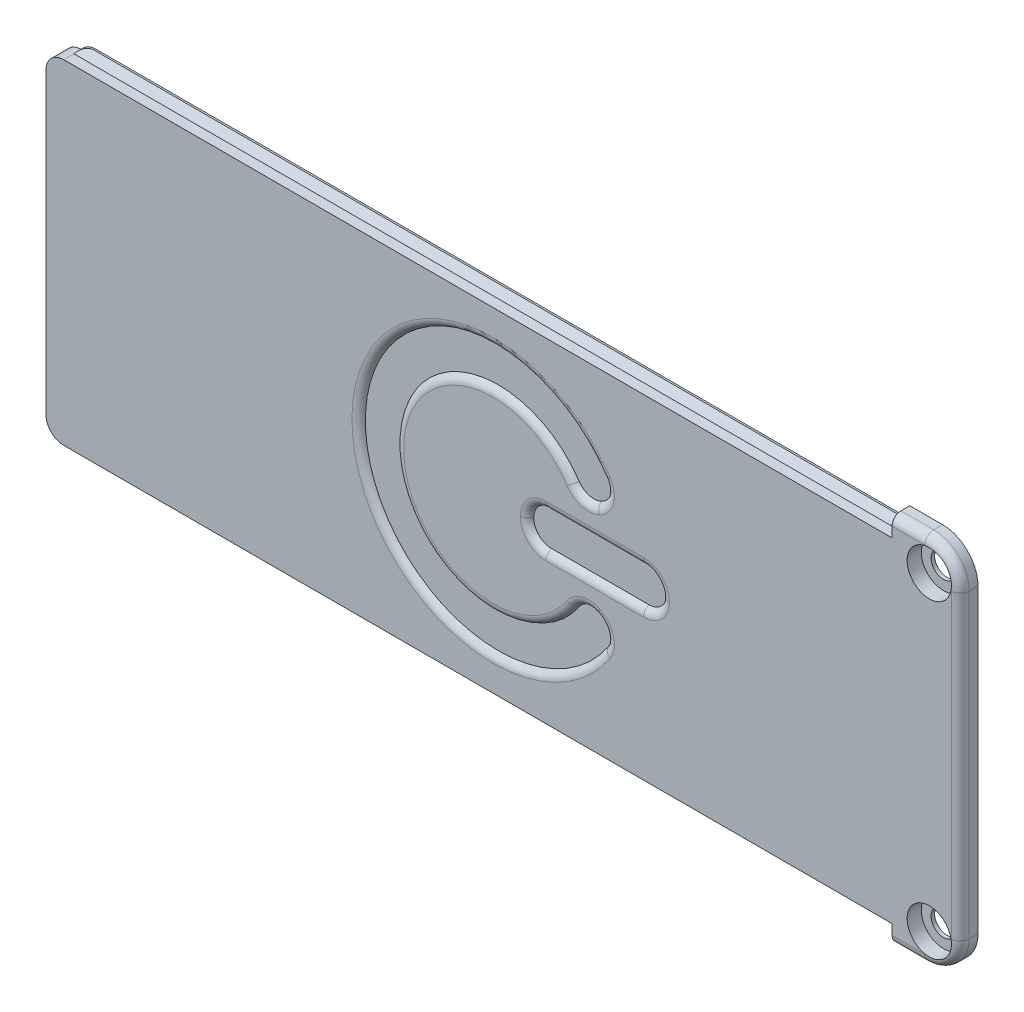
ISO-10303-21;
HEADER;
FILE_DESCRIPTION(('STEP AP214'),'2;1');
FILE_NAME('part.step','',(''),(''),'','','');
FILE_SCHEMA(('AUTOMOTIVE_DESIGN { 1 0 10303 214 1 1 1 1 }'));
ENDSEC;
DATA;
#1=APPLICATION_CONTEXT('core data for automotive mechanical design processes');
#2=APPLICATION_PROTOCOL_DEFINITION('international standard','automotive_design',2000,#1);
#3=PRODUCT_CONTEXT('',#1,'mechanical');
#4=PRODUCT('Part','Part','',(#3));
#5=PRODUCT_RELATED_PRODUCT_CATEGORY('part','',(#4));
#6=PRODUCT_DEFINITION_FORMATION('','',#4);
#7=PRODUCT_DEFINITION_CONTEXT('part definition',#1,'design');
#8=PRODUCT_DEFINITION('design','',#6,#7);
#9=PRODUCT_DEFINITION_SHAPE('','',#8);
#10=(LENGTH_UNIT() NAMED_UNIT(*) SI_UNIT(.MILLI.,.METRE.));
#11=(NAMED_UNIT(*) PLANE_ANGLE_UNIT() SI_UNIT($,.RADIAN.));
#12=(NAMED_UNIT(*) SI_UNIT($,.STERADIAN.) SOLID_ANGLE_UNIT());
#13=UNCERTAINTY_MEASURE_WITH_UNIT(LENGTH_MEASURE(1.E-05),#10,'distance_accuracy_value','');
#14=(GEOMETRIC_REPRESENTATION_CONTEXT(3) GLOBAL_UNCERTAINTY_ASSIGNED_CONTEXT((#13)) GLOBAL_UNIT_ASSIGNED_CONTEXT((#10,
#11,#12)) REPRESENTATION_CONTEXT('',''));
#15=CARTESIAN_POINT('',(0.,0.,0.));
#16=DIRECTION('',(0.,0.,1.));
#17=DIRECTION('',(1.,0.,0.));
#18=AXIS2_PLACEMENT_3D('',#15,#16,#17);
#19=CARTESIAN_POINT('',(0.,0.,2.));
#20=DIRECTION('',(0.,1.,0.));
#21=DIRECTION('',(0.,0.,1.));
#22=AXIS2_PLACEMENT_3D('',#19,#20,#21);
#23=PLANE('',#22);
#24=DIRECTION('',(1.,0.,0.));
#25=VECTOR('',#24,1.);
#26=CARTESIAN_POINT('',(2.,0.,0.85));
#27=LINE('',#26,#25);
#28=CARTESIAN_POINT('',(2.,0.,0.85));
#29=VERTEX_POINT('',#28);
#30=CARTESIAN_POINT('',(95.5,0.,0.850000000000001));
#31=VERTEX_POINT('',#30);
#32=EDGE_CURVE('E351',#29,#31,#27,.T.);
#33=ORIENTED_EDGE('',*,*,#32,.T.);
#34=DIRECTION('',(0.,0.,-1.));
#35=VECTOR('',#34,1.);
#36=CARTESIAN_POINT('',(95.5,0.,2.));
#37=LINE('',#36,#35);
#38=CARTESIAN_POINT('',(95.5,0.,2.));
#39=VERTEX_POINT('',#38);
#40=EDGE_CURVE('E431',#39,#31,#37,.T.);
#41=ORIENTED_EDGE('',*,*,#40,.F.);
#42=DIRECTION('',(1.,0.,0.));
#43=VECTOR('',#42,1.);
#44=CARTESIAN_POINT('',(0.,0.,2.));
#45=LINE('',#44,#43);
#46=CARTESIAN_POINT('',(2.,0.,2.));
#47=VERTEX_POINT('',#46);
#48=EDGE_CURVE('E400',#47,#39,#45,.T.);
#49=ORIENTED_EDGE('',*,*,#48,.F.);
#50=DIRECTION('',(0.,0.,-1.));
#51=VECTOR('',#50,1.);
#52=CARTESIAN_POINT('',(2.,0.,2.));
#53=LINE('',#52,#51);
#54=EDGE_CURVE('E719',#47,#29,#53,.T.);
#55=ORIENTED_EDGE('',*,*,#54,.T.);
#56=EDGE_LOOP('',(#33,#41,#49,#55));
#57=FACE_BOUND('',#56,.T.);
#58=ADVANCED_FACE('F36',(#57),#23,.F.);
#59=CARTESIAN_POINT('',(95.5,-2.15,2.));
#60=DIRECTION('',(1.,0.,0.));
#61=DIRECTION('',(0.,0.,-1.));
#62=AXIS2_PLACEMENT_3D('',#59,#60,#61);
#63=PLANE('',#62);
#64=DIRECTION('',(0.,0.,1.));
#65=VECTOR('',#64,1.);
#66=CARTESIAN_POINT('',(95.5,-0.85,0.));
#67=LINE('',#66,#65);
#68=CARTESIAN_POINT('',(95.5,-0.85,0.));
#69=VERTEX_POINT('',#68);
#70=CARTESIAN_POINT('',(95.5,-0.85,0.2));
#71=VERTEX_POINT('',#70);
#72=EDGE_CURVE('E343',#69,#71,#67,.T.);
#73=ORIENTED_EDGE('',*,*,#72,.F.);
#74=DIRECTION('',(0.,-1.,0.));
#75=VECTOR('',#74,1.);
#76=CARTESIAN_POINT('',(95.5,-2.15,0.));
#77=LINE('',#76,#75);
#78=CARTESIAN_POINT('',(95.5,-2.15,0.));
#79=VERTEX_POINT('',#78);
#80=EDGE_CURVE('E396',#69,#79,#77,.T.);
#81=ORIENTED_EDGE('',*,*,#80,.T.);
#82=DIRECTION('',(0.,0.,-1.));
#83=VECTOR('',#82,1.);
#84=CARTESIAN_POINT('',(95.5,-2.15,2.));
#85=LINE('',#84,#83);
#86=CARTESIAN_POINT('',(95.5,-2.15,1.));
#87=VERTEX_POINT('',#86);
#88=EDGE_CURVE('E428',#87,#79,#85,.T.);
#89=ORIENTED_EDGE('',*,*,#88,.F.);
#90=CARTESIAN_POINT('',(95.5,-1.15,1.));
#91=DIRECTION('',(1.,0.,0.));
#92=DIRECTION('',(0.,0.,-1.));
#93=AXIS2_PLACEMENT_3D('',#90,#91,#92);
#94=CIRCLE('',#93,1.);
#95=CARTESIAN_POINT('',(95.5,-1.15,2.));
#96=VERTEX_POINT('',#95);
#97=EDGE_CURVE('E557',#87,#96,#94,.F.);
#98=ORIENTED_EDGE('',*,*,#97,.T.);
#99=DIRECTION('',(0.,-1.,0.));
#100=VECTOR('',#99,1.);
#101=CARTESIAN_POINT('',(95.5,-2.15,2.));
#102=LINE('',#101,#100);
#103=EDGE_CURVE('E403',#39,#96,#102,.T.);
#104=ORIENTED_EDGE('',*,*,#103,.F.);
#105=ORIENTED_EDGE('',*,*,#40,.T.);
#106=DIRECTION('',(0.,0.794357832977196,0.607450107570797));
#107=VECTOR('',#106,1.);
#108=CARTESIAN_POINT('',(95.5,-0.85,0.2));
#109=LINE('',#108,#107);
#110=EDGE_CURVE('E352',#71,#31,#109,.T.);
#111=ORIENTED_EDGE('',*,*,#110,.F.);
#112=EDGE_LOOP('',(#73,#81,#89,#98,#104,#105,#111));
#113=FACE_BOUND('',#112,.T.);
#114=ADVANCED_FACE('F627',(#113),#63,.F.);
#115=CARTESIAN_POINT('',(95.5,37.7,2.));
#116=DIRECTION('',(1.,0.,0.));
#117=DIRECTION('',(0.,0.,-1.));
#118=AXIS2_PLACEMENT_3D('',#115,#116,#117);
#119=PLANE('',#118);
#120=DIRECTION('',(0.,0.794357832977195,-0.607450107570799));
#121=VECTOR('',#120,1.);
#122=CARTESIAN_POINT('',(95.5,38.55,0.2));
#123=LINE('',#122,#121);
#124=CARTESIAN_POINT('',(95.5,37.7,0.85));
#125=VERTEX_POINT('',#124);
#126=CARTESIAN_POINT('',(95.5,38.55,0.2));
#127=VERTEX_POINT('',#126);
#128=EDGE_CURVE('E362',#125,#127,#123,.T.);
#129=ORIENTED_EDGE('',*,*,#128,.F.);
#130=DIRECTION('',(0.,0.,-1.));
#131=VECTOR('',#130,1.);
#132=CARTESIAN_POINT('',(95.5,37.7,2.));
#133=LINE('',#132,#131);
#134=CARTESIAN_POINT('',(95.5,37.7,2.));
#135=VERTEX_POINT('',#134);
#136=EDGE_CURVE('E411',#135,#125,#133,.T.);
#137=ORIENTED_EDGE('',*,*,#136,.F.);
#138=DIRECTION('',(0.,-1.,0.));
#139=VECTOR('',#138,1.);
#140=CARTESIAN_POINT('',(95.5,37.7,2.));
#141=LINE('',#140,#139);
#142=CARTESIAN_POINT('',(95.5,38.85,2.));
#143=VERTEX_POINT('',#142);
#144=EDGE_CURVE('E406',#143,#135,#141,.T.);
#145=ORIENTED_EDGE('',*,*,#144,.F.);
#146=CARTESIAN_POINT('',(95.5,38.85,1.));
#147=DIRECTION('',(1.,0.,0.));
#148=DIRECTION('',(0.,0.,-1.));
#149=AXIS2_PLACEMENT_3D('',#146,#147,#148);
#150=CIRCLE('',#149,1.);
#151=CARTESIAN_POINT('',(95.5,39.85,1.));
#152=VERTEX_POINT('',#151);
#153=EDGE_CURVE('E545',#143,#152,#150,.F.);
#154=ORIENTED_EDGE('',*,*,#153,.T.);
#155=DIRECTION('',(0.,0.,-1.));
#156=VECTOR('',#155,1.);
#157=CARTESIAN_POINT('',(95.5,39.85,2.));
#158=LINE('',#157,#156);
#159=CARTESIAN_POINT('',(95.5,39.85,0.));
#160=VERTEX_POINT('',#159);
#161=EDGE_CURVE('E426',#152,#160,#158,.T.);
#162=ORIENTED_EDGE('',*,*,#161,.T.);
#163=DIRECTION('',(0.,-1.,0.));
#164=VECTOR('',#163,1.);
#165=CARTESIAN_POINT('',(95.5,37.7,0.));
#166=LINE('',#165,#164);
#167=CARTESIAN_POINT('',(95.5,38.55,0.));
#168=VERTEX_POINT('',#167);
#169=EDGE_CURVE('E401',#160,#168,#166,.T.);
#170=ORIENTED_EDGE('',*,*,#169,.T.);
#171=DIRECTION('',(0.,0.,-1.));
#172=VECTOR('',#171,1.);
#173=CARTESIAN_POINT('',(95.5,38.55,0.));
#174=LINE('',#173,#172);
#175=EDGE_CURVE('E365',#127,#168,#174,.T.);
#176=ORIENTED_EDGE('',*,*,#175,.F.);
#177=EDGE_LOOP('',(#129,#137,#145,#154,#162,#170,#176));
#178=FACE_BOUND('',#177,.T.);
#179=ADVANCED_FACE('F623',(#178),#119,.F.);
#180=CARTESIAN_POINT('',(0.,37.7,2.));
#181=DIRECTION('',(0.,-1.,0.));
#182=DIRECTION('',(0.,0.,-1.));
#183=AXIS2_PLACEMENT_3D('',#180,#181,#182);
#184=PLANE('',#183);
#185=DIRECTION('',(1.,0.,0.));
#186=VECTOR('',#185,1.);
#187=CARTESIAN_POINT('',(2.,37.7,0.85));
#188=LINE('',#187,#186);
#189=CARTESIAN_POINT('',(2.,37.7,0.85));
#190=VERTEX_POINT('',#189);
#191=EDGE_CURVE('E372',#190,#125,#188,.T.);
#192=ORIENTED_EDGE('',*,*,#191,.F.);
#193=DIRECTION('',(0.,0.,-1.));
#194=VECTOR('',#193,1.);
#195=CARTESIAN_POINT('',(2.,37.7,2.));
#196=LINE('',#195,#194);
#197=CARTESIAN_POINT('',(2.,37.7,2.));
#198=VERTEX_POINT('',#197);
#199=EDGE_CURVE('E1216',#190,#198,#196,.F.);
#200=ORIENTED_EDGE('',*,*,#199,.T.);
#201=DIRECTION('',(-1.,0.,0.));
#202=VECTOR('',#201,1.);
#203=CARTESIAN_POINT('',(0.,37.7,2.));
#204=LINE('',#203,#202);
#205=EDGE_CURVE('E408',#135,#198,#204,.T.);
#206=ORIENTED_EDGE('',*,*,#205,.F.);
#207=ORIENTED_EDGE('',*,*,#136,.T.);
#208=EDGE_LOOP('',(#192,#200,#206,#207));
#209=FACE_BOUND('',#208,.T.);
#210=ADVANCED_FACE('F597',(#209),#184,.F.);
#211=CARTESIAN_POINT('',(99.7,36.35,-8.));
#212=DIRECTION('',(0.,0.,1.));
#213=DIRECTION('',(1.,0.,0.));
#214=AXIS2_PLACEMENT_3D('',#211,#212,#213);
#215=CYLINDRICAL_SURFACE('',#214,1.4);
#216=CARTESIAN_POINT('',(99.7,36.35,0.));
#217=DIRECTION('',(0.,0.,-1.));
#218=DIRECTION('',(-1.,0.,0.));
#219=AXIS2_PLACEMENT_3D('',#216,#217,#218);
#220=CIRCLE('',#219,1.4);
#221=CARTESIAN_POINT('',(98.3,36.35,0.));
#222=VERTEX_POINT('',#221);
#223=EDGE_CURVE('E513',#222,#222,#220,.T.);
#224=ORIENTED_EDGE('',*,*,#223,.T.);
#225=EDGE_LOOP('',(#224));
#226=FACE_BOUND('',#225,.T.);
#227=CARTESIAN_POINT('',(99.7,36.35,0.399999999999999));
#228=DIRECTION('',(0.,0.,1.));
#229=DIRECTION('',(1.,0.,0.));
#230=AXIS2_PLACEMENT_3D('',#227,#228,#229);
#231=CIRCLE('',#230,1.4);
#232=CARTESIAN_POINT('',(101.1,36.35,0.399999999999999));
#233=VERTEX_POINT('',#232);
#234=EDGE_CURVE('E379',#233,#233,#231,.F.);
#235=ORIENTED_EDGE('',*,*,#234,.F.);
#236=EDGE_LOOP('',(#235));
#237=FACE_BOUND('',#236,.T.);
#238=ADVANCED_FACE('F593',(#226,#237),#215,.F.);
#239=CARTESIAN_POINT('',(99.7,1.35,-8.));
#240=DIRECTION('',(0.,0.,1.));
#241=DIRECTION('',(1.,0.,0.));
#242=AXIS2_PLACEMENT_3D('',#239,#240,#241);
#243=CYLINDRICAL_SURFACE('',#242,1.4);
#244=CARTESIAN_POINT('',(99.7,1.35,0.));
#245=DIRECTION('',(0.,0.,-1.));
#246=DIRECTION('',(-1.,0.,0.));
#247=AXIS2_PLACEMENT_3D('',#244,#245,#246);
#248=CIRCLE('',#247,1.4);
#249=CARTESIAN_POINT('',(98.3,1.35,0.));
#250=VERTEX_POINT('',#249);
#251=EDGE_CURVE('E498',#250,#250,#248,.T.);
#252=ORIENTED_EDGE('',*,*,#251,.T.);
#253=EDGE_LOOP('',(#252));
#254=FACE_BOUND('',#253,.T.);
#255=CARTESIAN_POINT('',(99.7,1.35,0.399999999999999));
#256=DIRECTION('',(0.,0.,1.));
#257=DIRECTION('',(1.,0.,0.));
#258=AXIS2_PLACEMENT_3D('',#255,#256,#257);
#259=CIRCLE('',#258,1.4);
#260=CARTESIAN_POINT('',(101.1,1.35,0.399999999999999));
#261=VERTEX_POINT('',#260);
#262=EDGE_CURVE('E384',#261,#261,#259,.F.);
#263=ORIENTED_EDGE('',*,*,#262,.F.);
#264=EDGE_LOOP('',(#263));
#265=FACE_BOUND('',#264,.T.);
#266=ADVANCED_FACE('F596',(#254,#265),#243,.F.);
#267=CARTESIAN_POINT('',(0.,0.,2.));
#268=DIRECTION('',(1.,0.,0.));
#269=DIRECTION('',(0.,0.,-1.));
#270=AXIS2_PLACEMENT_3D('',#267,#268,#269);
#271=PLANE('',#270);
#272=DIRECTION('',(0.,0.,-1.));
#273=VECTOR('',#272,1.);
#274=CARTESIAN_POINT('',(0.,35.7,2.));
#275=LINE('',#274,#273);
#276=CARTESIAN_POINT('',(0.,35.7,2.));
#277=VERTEX_POINT('',#276);
#278=CARTESIAN_POINT('',(0.,35.7,0.85));
#279=VERTEX_POINT('',#278);
#280=EDGE_CURVE('E1206',#277,#279,#275,.T.);
#281=ORIENTED_EDGE('',*,*,#280,.T.);
#282=DIRECTION('',(0.,-1.,0.));
#283=VECTOR('',#282,1.);
#284=CARTESIAN_POINT('',(0.,35.7,0.85));
#285=LINE('',#284,#283);
#286=CARTESIAN_POINT('',(0.,2.,0.85));
#287=VERTEX_POINT('',#286);
#288=EDGE_CURVE('E340',#279,#287,#285,.T.);
#289=ORIENTED_EDGE('',*,*,#288,.T.);
#290=DIRECTION('',(0.,0.,-1.));
#291=VECTOR('',#290,1.);
#292=CARTESIAN_POINT('',(0.,2.,2.));
#293=LINE('',#292,#291);
#294=CARTESIAN_POINT('',(0.,2.,2.));
#295=VERTEX_POINT('',#294);
#296=EDGE_CURVE('E1210',#287,#295,#293,.F.);
#297=ORIENTED_EDGE('',*,*,#296,.T.);
#298=DIRECTION('',(0.,-1.,0.));
#299=VECTOR('',#298,1.);
#300=CARTESIAN_POINT('',(0.,0.,2.));
#301=LINE('',#300,#299);
#302=EDGE_CURVE('E397',#277,#295,#301,.T.);
#303=ORIENTED_EDGE('',*,*,#302,.F.);
#304=EDGE_LOOP('',(#281,#289,#297,#303));
#305=FACE_BOUND('',#304,.T.);
#306=ADVANCED_FACE('F601',(#305),#271,.F.);
#307=CARTESIAN_POINT('',(103.2,-2.15,2.));
#308=DIRECTION('',(0.,1.,0.));
#309=DIRECTION('',(0.,0.,1.));
#310=AXIS2_PLACEMENT_3D('',#307,#308,#309);
#311=PLANE('',#310);
#312=DIRECTION('',(0.,0.,-1.));
#313=VECTOR('',#312,1.);
#314=CARTESIAN_POINT('',(99.2,-2.15,2.));
#315=LINE('',#314,#313);
#316=CARTESIAN_POINT('',(99.2,-2.15,0.));
#317=VERTEX_POINT('',#316);
#318=CARTESIAN_POINT('',(99.2,-2.15,1.));
#319=VERTEX_POINT('',#318);
#320=EDGE_CURVE('E527',#317,#319,#315,.F.);
#321=ORIENTED_EDGE('',*,*,#320,.T.);
#322=DIRECTION('',(1.,0.,0.));
#323=VECTOR('',#322,1.);
#324=CARTESIAN_POINT('',(103.2,-2.15,1.));
#325=LINE('',#324,#323);
#326=EDGE_CURVE('E555',#319,#87,#325,.F.);
#327=ORIENTED_EDGE('',*,*,#326,.T.);
#328=ORIENTED_EDGE('',*,*,#88,.T.);
#329=DIRECTION('',(1.,0.,0.));
#330=VECTOR('',#329,1.);
#331=CARTESIAN_POINT('',(103.2,-2.15,0.));
#332=LINE('',#331,#330);
#333=EDGE_CURVE('E413',#79,#317,#332,.T.);
#334=ORIENTED_EDGE('',*,*,#333,.T.);
#335=EDGE_LOOP('',(#321,#327,#328,#334));
#336=FACE_BOUND('',#335,.T.);
#337=ADVANCED_FACE('F635',(#336),#311,.F.);
#338=CARTESIAN_POINT('',(103.2,-2.15,2.));
#339=DIRECTION('',(-1.,0.,0.));
#340=DIRECTION('',(0.,0.,1.));
#341=AXIS2_PLACEMENT_3D('',#338,#339,#340);
#342=PLANE('',#341);
#343=DIRECTION('',(0.,0.,-1.));
#344=VECTOR('',#343,1.);
#345=CARTESIAN_POINT('',(103.2,35.85,2.));
#346=LINE('',#345,#344);
#347=CARTESIAN_POINT('',(103.2,35.85,0.));
#348=VERTEX_POINT('',#347);
#349=CARTESIAN_POINT('',(103.2,35.85,1.));
#350=VERTEX_POINT('',#349);
#351=EDGE_CURVE('E524',#348,#350,#346,.F.);
#352=ORIENTED_EDGE('',*,*,#351,.T.);
#353=DIRECTION('',(0.,1.,0.));
#354=VECTOR('',#353,1.);
#355=CARTESIAN_POINT('',(103.2,-2.15,1.));
#356=LINE('',#355,#354);
#357=CARTESIAN_POINT('',(103.2,1.85,1.));
#358=VERTEX_POINT('',#357);
#359=EDGE_CURVE('E551',#350,#358,#356,.F.);
#360=ORIENTED_EDGE('',*,*,#359,.T.);
#361=DIRECTION('',(0.,0.,-1.));
#362=VECTOR('',#361,1.);
#363=CARTESIAN_POINT('',(103.2,1.85,2.));
#364=LINE('',#363,#362);
#365=CARTESIAN_POINT('',(103.2,1.85,0.));
#366=VERTEX_POINT('',#365);
#367=EDGE_CURVE('E522',#358,#366,#364,.T.);
#368=ORIENTED_EDGE('',*,*,#367,.T.);
#369=DIRECTION('',(0.,1.,0.));
#370=VECTOR('',#369,1.);
#371=CARTESIAN_POINT('',(103.2,-2.15,0.));
#372=LINE('',#371,#370);
#373=EDGE_CURVE('E416',#366,#348,#372,.T.);
#374=ORIENTED_EDGE('',*,*,#373,.T.);
#375=EDGE_LOOP('',(#352,#360,#368,#374));
#376=FACE_BOUND('',#375,.T.);
#377=ADVANCED_FACE('F631',(#376),#342,.F.);
#378=CARTESIAN_POINT('',(103.2,39.85,2.));
#379=DIRECTION('',(0.,-1.,0.));
#380=DIRECTION('',(0.,0.,-1.));
#381=AXIS2_PLACEMENT_3D('',#378,#379,#380);
#382=PLANE('',#381);
#383=ORIENTED_EDGE('',*,*,#161,.F.);
#384=DIRECTION('',(-1.,0.,0.));
#385=VECTOR('',#384,1.);
#386=CARTESIAN_POINT('',(103.2,39.85,1.));
#387=LINE('',#386,#385);
#388=CARTESIAN_POINT('',(99.2,39.85,1.));
#389=VERTEX_POINT('',#388);
#390=EDGE_CURVE('E547',#152,#389,#387,.F.);
#391=ORIENTED_EDGE('',*,*,#390,.T.);
#392=DIRECTION('',(0.,0.,-1.));
#393=VECTOR('',#392,1.);
#394=CARTESIAN_POINT('',(99.2,39.85,2.));
#395=LINE('',#394,#393);
#396=CARTESIAN_POINT('',(99.2,39.85,0.));
#397=VERTEX_POINT('',#396);
#398=EDGE_CURVE('E478',#389,#397,#395,.T.);
#399=ORIENTED_EDGE('',*,*,#398,.T.);
#400=DIRECTION('',(-1.,0.,0.));
#401=VECTOR('',#400,1.);
#402=CARTESIAN_POINT('',(103.2,39.85,0.));
#403=LINE('',#402,#401);
#404=EDGE_CURVE('E419',#397,#160,#403,.T.);
#405=ORIENTED_EDGE('',*,*,#404,.T.);
#406=EDGE_LOOP('',(#383,#391,#399,#405));
#407=FACE_BOUND('',#406,.T.);
#408=ADVANCED_FACE('F616',(#407),#382,.F.);
#409=CARTESIAN_POINT('',(0.,0.,2.));
#410=DIRECTION('',(0.,0.,-1.));
#411=DIRECTION('',(-1.,0.,0.));
#412=AXIS2_PLACEMENT_3D('',#409,#410,#411);
#413=PLANE('',#412);
#414=DIRECTION('',(-1.,0.,0.));
#415=VECTOR('',#414,1.);
#416=CARTESIAN_POINT('',(0.,15.9334848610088,2.));
#417=LINE('',#416,#415);
#418=CARTESIAN_POINT('',(67.45,15.9334848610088,2.));
#419=VERTEX_POINT('',#418);
#420=CARTESIAN_POINT('',(56.45,15.9334848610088,2.));
#421=VERTEX_POINT('',#420);
#422=EDGE_CURVE('E465',#419,#421,#417,.T.);
#423=ORIENTED_EDGE('',*,*,#422,.T.);
#424=CARTESIAN_POINT('',(56.45,18.85,2.));
#425=DIRECTION('',(0.,0.,-1.));
#426=DIRECTION('',(-1.,0.,0.));
#427=AXIS2_PLACEMENT_3D('',#424,#425,#426);
#428=CIRCLE('',#427,2.91651513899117);
#429=CARTESIAN_POINT('',(53.5334848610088,18.85,2.));
#430=VERTEX_POINT('',#429);
#431=EDGE_CURVE('E475',#421,#430,#428,.T.);
#432=ORIENTED_EDGE('',*,*,#431,.T.);
#433=CARTESIAN_POINT('',(56.45,18.85,2.));
#434=DIRECTION('',(0.,0.,-1.));
#435=DIRECTION('',(-1.,0.,0.));
#436=AXIS2_PLACEMENT_3D('',#433,#434,#435);
#437=CIRCLE('',#436,2.91651513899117);
#438=CARTESIAN_POINT('',(56.45,21.7665151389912,2.));
#439=VERTEX_POINT('',#438);
#440=EDGE_CURVE('E473',#430,#439,#437,.T.);
#441=ORIENTED_EDGE('',*,*,#440,.T.);
#442=DIRECTION('',(1.,0.,0.));
#443=VECTOR('',#442,1.);
#444=CARTESIAN_POINT('',(0.,21.7665151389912,2.));
#445=LINE('',#444,#443);
#446=CARTESIAN_POINT('',(67.45,21.7665151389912,2.));
#447=VERTEX_POINT('',#446);
#448=EDGE_CURVE('E471',#439,#447,#445,.T.);
#449=ORIENTED_EDGE('',*,*,#448,.T.);
#450=CARTESIAN_POINT('',(67.45,18.85,2.));
#451=DIRECTION('',(0.,0.,-1.));
#452=DIRECTION('',(-1.,0.,0.));
#453=AXIS2_PLACEMENT_3D('',#450,#451,#452);
#454=CIRCLE('',#453,2.91651513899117);
#455=CARTESIAN_POINT('',(70.3665151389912,18.85,2.));
#456=VERTEX_POINT('',#455);
#457=EDGE_CURVE('E469',#447,#456,#454,.T.);
#458=ORIENTED_EDGE('',*,*,#457,.T.);
#459=CARTESIAN_POINT('',(67.45,18.85,2.));
#460=DIRECTION('',(0.,0.,-1.));
#461=DIRECTION('',(-1.,0.,0.));
#462=AXIS2_PLACEMENT_3D('',#459,#460,#461);
#463=CIRCLE('',#462,2.91651513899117);
#464=EDGE_CURVE('E467',#456,#419,#463,.T.);
#465=ORIENTED_EDGE('',*,*,#464,.T.);
#466=EDGE_LOOP('',(#423,#432,#441,#449,#458,#465));
#467=FACE_BOUND('',#466,.T.);
#468=CARTESIAN_POINT('',(50.45,18.85,2.));
#469=DIRECTION('',(0.,0.,-1.));
#470=DIRECTION('',(-1.,0.,0.));
#471=AXIS2_PLACEMENT_3D('',#468,#469,#470);
#472=CIRCLE('',#471,15.9165151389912);
#473=CARTESIAN_POINT('',(63.6686631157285,9.98420056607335,2.));
#474=VERTEX_POINT('',#473);
#475=CARTESIAN_POINT('',(63.6686631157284,27.7157994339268,2.));
#476=VERTEX_POINT('',#475);
#477=EDGE_CURVE('E452',#474,#476,#472,.T.);
#478=ORIENTED_EDGE('',*,*,#477,.T.);
#479=CARTESIAN_POINT('',(61.2464977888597,26.0912454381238,2.));
#480=DIRECTION('',(0.,0.,-1.));
#481=DIRECTION('',(-1.,0.,0.));
#482=AXIS2_PLACEMENT_3D('',#479,#480,#481);
#483=CIRCLE('',#482,2.91651513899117);
#484=CARTESIAN_POINT('',(62.4790703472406,23.4479850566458,2.));
#485=VERTEX_POINT('',#484);
#486=EDGE_CURVE('E462',#476,#485,#483,.T.);
#487=ORIENTED_EDGE('',*,*,#486,.T.);
#488=CARTESIAN_POINT('',(61.2464977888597,26.0912454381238,2.));
#489=DIRECTION('',(0.,0.,-1.));
#490=DIRECTION('',(-1.,0.,0.));
#491=AXIS2_PLACEMENT_3D('',#488,#489,#490);
#492=CIRCLE('',#491,2.91651513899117);
#493=CARTESIAN_POINT('',(58.8243324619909,24.4666914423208,2.));
#494=VERTEX_POINT('',#493);
#495=EDGE_CURVE('E460',#485,#494,#492,.T.);
#496=ORIENTED_EDGE('',*,*,#495,.T.);
#497=CARTESIAN_POINT('',(50.45,18.85,2.));
#498=DIRECTION('',(0.,0.,-1.));
#499=DIRECTION('',(-1.,0.,0.));
#500=AXIS2_PLACEMENT_3D('',#497,#498,#499);
#501=CIRCLE('',#500,10.0834848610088);
#502=CARTESIAN_POINT('',(58.824332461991,13.2333085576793,2.));
#503=VERTEX_POINT('',#502);
#504=EDGE_CURVE('E458',#494,#503,#501,.F.);
#505=ORIENTED_EDGE('',*,*,#504,.T.);
#506=CARTESIAN_POINT('',(61.2464977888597,11.6087545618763,2.));
#507=DIRECTION('',(0.,0.,-1.));
#508=DIRECTION('',(-1.,0.,0.));
#509=AXIS2_PLACEMENT_3D('',#506,#507,#508);
#510=CIRCLE('',#509,2.91651513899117);
#511=CARTESIAN_POINT('',(62.4790703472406,14.2520149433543,2.));
#512=VERTEX_POINT('',#511);
#513=EDGE_CURVE('E456',#503,#512,#510,.T.);
#514=ORIENTED_EDGE('',*,*,#513,.T.);
#515=CARTESIAN_POINT('',(61.2464977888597,11.6087545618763,2.));
#516=DIRECTION('',(0.,0.,-1.));
#517=DIRECTION('',(-1.,0.,0.));
#518=AXIS2_PLACEMENT_3D('',#515,#516,#517);
#519=CIRCLE('',#518,2.91651513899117);
#520=EDGE_CURVE('E454',#512,#474,#519,.T.);
#521=ORIENTED_EDGE('',*,*,#520,.T.);
#522=EDGE_LOOP('',(#478,#487,#496,#505,#514,#521));
#523=FACE_BOUND('',#522,.T.);
#524=ORIENTED_EDGE('',*,*,#302,.T.);
#525=CARTESIAN_POINT('',(2.,2.,2.));
#526=DIRECTION('',(0.,0.,-1.));
#527=DIRECTION('',(-1.,0.,0.));
#528=AXIS2_PLACEMENT_3D('',#525,#526,#527);
#529=CIRCLE('',#528,2.);
#530=EDGE_CURVE('E1154',#295,#47,#529,.F.);
#531=ORIENTED_EDGE('',*,*,#530,.T.);
#532=ORIENTED_EDGE('',*,*,#48,.T.);
#533=ORIENTED_EDGE('',*,*,#103,.T.);
#534=DIRECTION('',(1.,0.,0.));
#535=VECTOR('',#534,1.);
#536=CARTESIAN_POINT('',(0.,-1.15,2.));
#537=LINE('',#536,#535);
#538=CARTESIAN_POINT('',(99.2,-1.15,2.));
#539=VERTEX_POINT('',#538);
#540=EDGE_CURVE('E530',#96,#539,#537,.T.);
#541=ORIENTED_EDGE('',*,*,#540,.T.);
#542=CARTESIAN_POINT('',(99.2,1.85,2.));
#543=DIRECTION('',(0.,0.,-1.));
#544=DIRECTION('',(-1.,0.,0.));
#545=AXIS2_PLACEMENT_3D('',#542,#543,#544);
#546=CIRCLE('',#545,3.);
#547=CARTESIAN_POINT('',(99.4614109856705,-1.13858901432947,2.));
#548=VERTEX_POINT('',#547);
#549=EDGE_CURVE('E533',#539,#548,#546,.F.);
#550=ORIENTED_EDGE('',*,*,#549,.T.);
#551=CARTESIAN_POINT('',(99.7,1.35,2.));
#552=DIRECTION('',(0.,0.,1.));
#553=DIRECTION('',(1.,0.,0.));
#554=AXIS2_PLACEMENT_3D('',#551,#552,#553);
#555=CIRCLE('',#554,2.50000000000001);
#556=CARTESIAN_POINT('',(102.188589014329,1.58858901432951,2.));
#557=VERTEX_POINT('',#556);
#558=EDGE_CURVE('E385',#557,#548,#555,.T.);
#559=ORIENTED_EDGE('',*,*,#558,.F.);
#560=CARTESIAN_POINT('',(102.2,1.85,2.));
#561=VERTEX_POINT('',#560);
#562=EDGE_CURVE('E532',#557,#561,#546,.F.);
#563=ORIENTED_EDGE('',*,*,#562,.T.);
#564=DIRECTION('',(0.,1.,0.));
#565=VECTOR('',#564,1.);
#566=CARTESIAN_POINT('',(102.2,0.,2.));
#567=LINE('',#566,#565);
#568=CARTESIAN_POINT('',(102.2,35.85,2.));
#569=VERTEX_POINT('',#568);
#570=EDGE_CURVE('E536',#561,#569,#567,.T.);
#571=ORIENTED_EDGE('',*,*,#570,.T.);
#572=CARTESIAN_POINT('',(99.2,35.85,2.));
#573=DIRECTION('',(0.,0.,-1.));
#574=DIRECTION('',(-1.,0.,0.));
#575=AXIS2_PLACEMENT_3D('',#572,#573,#574);
#576=CIRCLE('',#575,3.);
#577=CARTESIAN_POINT('',(102.188589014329,36.1114109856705,2.));
#578=VERTEX_POINT('',#577);
#579=EDGE_CURVE('E539',#569,#578,#576,.F.);
#580=ORIENTED_EDGE('',*,*,#579,.T.);
#581=CARTESIAN_POINT('',(99.7,36.35,2.));
#582=DIRECTION('',(0.,0.,1.));
#583=DIRECTION('',(1.,0.,0.));
#584=AXIS2_PLACEMENT_3D('',#581,#582,#583);
#585=CIRCLE('',#584,2.50000000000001);
#586=CARTESIAN_POINT('',(99.4614109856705,38.8385890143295,2.));
#587=VERTEX_POINT('',#586);
#588=EDGE_CURVE('E375',#587,#578,#585,.T.);
#589=ORIENTED_EDGE('',*,*,#588,.F.);
#590=CARTESIAN_POINT('',(99.2,38.85,2.));
#591=VERTEX_POINT('',#590);
#592=EDGE_CURVE('E538',#587,#591,#576,.F.);
#593=ORIENTED_EDGE('',*,*,#592,.T.);
#594=DIRECTION('',(-1.,0.,0.));
#595=VECTOR('',#594,1.);
#596=CARTESIAN_POINT('',(0.,38.85,2.));
#597=LINE('',#596,#595);
#598=EDGE_CURVE('E542',#591,#143,#597,.T.);
#599=ORIENTED_EDGE('',*,*,#598,.T.);
#600=ORIENTED_EDGE('',*,*,#144,.T.);
#601=ORIENTED_EDGE('',*,*,#205,.T.);
#602=CARTESIAN_POINT('',(2.,35.7,2.));
#603=DIRECTION('',(0.,0.,-1.));
#604=DIRECTION('',(-1.,0.,0.));
#605=AXIS2_PLACEMENT_3D('',#602,#603,#604);
#606=CIRCLE('',#605,2.);
#607=EDGE_CURVE('E1214',#198,#277,#606,.F.);
#608=ORIENTED_EDGE('',*,*,#607,.T.);
#609=EDGE_LOOP('',(#524,#531,#532,#533,#541,#550,#559,#563,#571,#580,#589,#593,#599,#600,#601,#608));
#610=FACE_BOUND('',#609,.T.);
#611=ADVANCED_FACE('F613',(#467,#523,#610),#413,.F.);
#612=CARTESIAN_POINT('',(0.,0.,0.));
#613=DIRECTION('',(0.,0.,-1.));
#614=DIRECTION('',(-1.,0.,0.));
#615=AXIS2_PLACEMENT_3D('',#612,#613,#614);
#616=PLANE('',#615);
#617=DIRECTION('',(0.,-1.,0.));
#618=VECTOR('',#617,1.);
#619=CARTESIAN_POINT('',(24.5,30.7,0.));
#620=LINE('',#619,#618);
#621=CARTESIAN_POINT('',(24.5,30.7,0.));
#622=VERTEX_POINT('',#621);
#623=CARTESIAN_POINT('',(24.5,22.7,0.));
#624=VERTEX_POINT('',#623);
#625=EDGE_CURVE('E51',#622,#624,#620,.T.);
#626=ORIENTED_EDGE('',*,*,#625,.F.);
#627=DIRECTION('',(1.,0.,0.));
#628=VECTOR('',#627,1.);
#629=CARTESIAN_POINT('',(24.5,30.7,0.));
#630=LINE('',#629,#628);
#631=CARTESIAN_POINT('',(16.5,30.7,0.));
#632=VERTEX_POINT('',#631);
#633=EDGE_CURVE('E320',#632,#622,#630,.T.);
#634=ORIENTED_EDGE('',*,*,#633,.F.);
#635=DIRECTION('',(0.,1.,0.));
#636=VECTOR('',#635,1.);
#637=CARTESIAN_POINT('',(16.5,30.7,0.));
#638=LINE('',#637,#636);
#639=CARTESIAN_POINT('',(16.5,22.7,0.));
#640=VERTEX_POINT('',#639);
#641=EDGE_CURVE('E323',#640,#632,#638,.T.);
#642=ORIENTED_EDGE('',*,*,#641,.F.);
#643=DIRECTION('',(-1.,0.,0.));
#644=VECTOR('',#643,1.);
#645=CARTESIAN_POINT('',(24.5,22.7,0.));
#646=LINE('',#645,#644);
#647=EDGE_CURVE('E329',#624,#640,#646,.T.);
#648=ORIENTED_EDGE('',*,*,#647,.F.);
#649=EDGE_LOOP('',(#626,#634,#642,#648));
#650=FACE_BOUND('',#649,.T.);
#651=CARTESIAN_POINT('',(2.,2.,0.));
#652=DIRECTION('',(0.,0.,-1.));
#653=DIRECTION('',(-1.,0.,0.));
#654=AXIS2_PLACEMENT_3D('',#651,#652,#653);
#655=CIRCLE('',#654,2.);
#656=CARTESIAN_POINT('',(2.,0.,0.));
#657=VERTEX_POINT('',#656);
#658=CARTESIAN_POINT('',(0.,2.,0.));
#659=VERTEX_POINT('',#658);
#660=EDGE_CURVE('E1204',#657,#659,#655,.T.);
#661=ORIENTED_EDGE('',*,*,#660,.T.);
#662=CARTESIAN_POINT('',(1.15,3.63630681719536,0.));
#663=DIRECTION('',(0.,0.,-1.));
#664=DIRECTION('',(-1.,0.,0.));
#665=AXIS2_PLACEMENT_3D('',#662,#663,#664);
#666=CIRCLE('',#665,2.);
#667=CARTESIAN_POINT('',(-0.85,3.63630681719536,0.));
#668=VERTEX_POINT('',#667);
#669=EDGE_CURVE('E1181',#659,#668,#666,.T.);
#670=ORIENTED_EDGE('',*,*,#669,.T.);
#671=DIRECTION('',(0.,-1.,0.));
#672=VECTOR('',#671,1.);
#673=CARTESIAN_POINT('',(-0.85,35.7,0.));
#674=LINE('',#673,#672);
#675=CARTESIAN_POINT('',(-0.85,34.0636931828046,0.));
#676=VERTEX_POINT('',#675);
#677=EDGE_CURVE('E341',#676,#668,#674,.T.);
#678=ORIENTED_EDGE('',*,*,#677,.F.);
#679=CARTESIAN_POINT('',(1.15,34.0636931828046,0.));
#680=DIRECTION('',(0.,0.,-1.));
#681=DIRECTION('',(-1.,0.,0.));
#682=AXIS2_PLACEMENT_3D('',#679,#680,#681);
#683=CIRCLE('',#682,2.);
#684=CARTESIAN_POINT('',(0.,35.7,0.));
#685=VERTEX_POINT('',#684);
#686=EDGE_CURVE('E1179',#676,#685,#683,.T.);
#687=ORIENTED_EDGE('',*,*,#686,.T.);
#688=CARTESIAN_POINT('',(2.,35.7,0.));
#689=DIRECTION('',(0.,0.,-1.));
#690=DIRECTION('',(-1.,0.,0.));
#691=AXIS2_PLACEMENT_3D('',#688,#689,#690);
#692=CIRCLE('',#691,2.);
#693=CARTESIAN_POINT('',(2.,37.7,0.));
#694=VERTEX_POINT('',#693);
#695=EDGE_CURVE('E1197',#685,#694,#692,.T.);
#696=ORIENTED_EDGE('',*,*,#695,.T.);
#697=CARTESIAN_POINT('',(3.63630681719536,36.55,0.));
#698=DIRECTION('',(0.,0.,-1.));
#699=DIRECTION('',(-1.,0.,0.));
#700=AXIS2_PLACEMENT_3D('',#697,#698,#699);
#701=CIRCLE('',#700,2.);
#702=CARTESIAN_POINT('',(3.63630681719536,38.55,0.));
#703=VERTEX_POINT('',#702);
#704=EDGE_CURVE('E1167',#694,#703,#701,.T.);
#705=ORIENTED_EDGE('',*,*,#704,.T.);
#706=DIRECTION('',(1.,0.,0.));
#707=VECTOR('',#706,1.);
#708=CARTESIAN_POINT('',(2.,38.55,0.));
#709=LINE('',#708,#707);
#710=EDGE_CURVE('E368',#703,#168,#709,.T.);
#711=ORIENTED_EDGE('',*,*,#710,.T.);
#712=ORIENTED_EDGE('',*,*,#169,.F.);
#713=ORIENTED_EDGE('',*,*,#404,.F.);
#714=CARTESIAN_POINT('',(99.2,35.85,0.));
#715=DIRECTION('',(0.,0.,-1.));
#716=DIRECTION('',(-1.,0.,0.));
#717=AXIS2_PLACEMENT_3D('',#714,#715,#716);
#718=CIRCLE('',#717,4.);
#719=EDGE_CURVE('E520',#397,#348,#718,.T.);
#720=ORIENTED_EDGE('',*,*,#719,.T.);
#721=ORIENTED_EDGE('',*,*,#373,.F.);
#722=CARTESIAN_POINT('',(99.2,1.85,0.));
#723=DIRECTION('',(0.,0.,-1.));
#724=DIRECTION('',(-1.,0.,0.));
#725=AXIS2_PLACEMENT_3D('',#722,#723,#724);
#726=CIRCLE('',#725,4.);
#727=EDGE_CURVE('E518',#366,#317,#726,.T.);
#728=ORIENTED_EDGE('',*,*,#727,.T.);
#729=ORIENTED_EDGE('',*,*,#333,.F.);
#730=ORIENTED_EDGE('',*,*,#80,.F.);
#731=DIRECTION('',(1.,0.,0.));
#732=VECTOR('',#731,1.);
#733=CARTESIAN_POINT('',(2.,-0.85,0.));
#734=LINE('',#733,#732);
#735=CARTESIAN_POINT('',(3.63630681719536,-0.85,0.));
#736=VERTEX_POINT('',#735);
#737=EDGE_CURVE('E360',#736,#69,#734,.T.);
#738=ORIENTED_EDGE('',*,*,#737,.F.);
#739=CARTESIAN_POINT('',(3.63630681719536,1.15,0.));
#740=DIRECTION('',(0.,0.,-1.));
#741=DIRECTION('',(-1.,0.,0.));
#742=AXIS2_PLACEMENT_3D('',#739,#740,#741);
#743=CIRCLE('',#742,2.);
#744=EDGE_CURVE('E1166',#736,#657,#743,.T.);
#745=ORIENTED_EDGE('',*,*,#744,.T.);
#746=EDGE_LOOP('',(#661,#670,#678,#687,#696,#705,#711,#712,#713,#720,#721,#728,#729,#730,#738,#745));
#747=FACE_BOUND('',#746,.T.);
#748=ORIENTED_EDGE('',*,*,#223,.F.);
#749=EDGE_LOOP('',(#748));
#750=FACE_BOUND('',#749,.T.);
#751=ORIENTED_EDGE('',*,*,#251,.F.);
#752=EDGE_LOOP('',(#751));
#753=FACE_BOUND('',#752,.T.);
#754=ADVANCED_FACE('F611',(#650,#747,#750,#753),#616,.T.);
#755=CARTESIAN_POINT('',(0.,0.,1.4));
#756=DIRECTION('',(0.,0.,1.));
#757=DIRECTION('',(1.,0.,0.));
#758=AXIS2_PLACEMENT_3D('',#755,#756,#757);
#759=PLANE('',#758);
#760=CARTESIAN_POINT('',(67.45,18.85,1.4));
#761=DIRECTION('',(0.,0.,1.));
#762=DIRECTION('',(1.,0.,0.));
#763=AXIS2_PLACEMENT_3D('',#760,#761,#762);
#764=CIRCLE('',#763,2.);
#765=CARTESIAN_POINT('',(67.45,16.85,1.4));
#766=VERTEX_POINT('',#765);
#767=CARTESIAN_POINT('',(69.45,18.85,1.4));
#768=VERTEX_POINT('',#767);
#769=EDGE_CURVE('E439',#766,#768,#764,.T.);
#770=ORIENTED_EDGE('',*,*,#769,.T.);
#771=CARTESIAN_POINT('',(67.45,18.85,1.4));
#772=DIRECTION('',(0.,0.,1.));
#773=DIRECTION('',(1.,0.,0.));
#774=AXIS2_PLACEMENT_3D('',#771,#772,#773);
#775=CIRCLE('',#774,2.);
#776=CARTESIAN_POINT('',(67.45,20.85,1.4));
#777=VERTEX_POINT('',#776);
#778=EDGE_CURVE('E441',#768,#777,#775,.T.);
#779=ORIENTED_EDGE('',*,*,#778,.T.);
#780=DIRECTION('',(-1.,0.,0.));
#781=VECTOR('',#780,1.);
#782=CARTESIAN_POINT('',(54.45,20.85,1.4));
#783=LINE('',#782,#781);
#784=CARTESIAN_POINT('',(56.45,20.85,1.4));
#785=VERTEX_POINT('',#784);
#786=EDGE_CURVE('E394',#777,#785,#783,.T.);
#787=ORIENTED_EDGE('',*,*,#786,.T.);
#788=CARTESIAN_POINT('',(56.45,18.85,1.4));
#789=DIRECTION('',(0.,0.,1.));
#790=DIRECTION('',(1.,0.,0.));
#791=AXIS2_PLACEMENT_3D('',#788,#789,#790);
#792=CIRCLE('',#791,2.);
#793=CARTESIAN_POINT('',(54.45,18.85,1.4));
#794=VERTEX_POINT('',#793);
#795=EDGE_CURVE('E437',#785,#794,#792,.T.);
#796=ORIENTED_EDGE('',*,*,#795,.T.);
#797=CARTESIAN_POINT('',(56.45,18.85,1.4));
#798=DIRECTION('',(0.,0.,1.));
#799=DIRECTION('',(1.,0.,0.));
#800=AXIS2_PLACEMENT_3D('',#797,#798,#799);
#801=CIRCLE('',#800,2.);
#802=CARTESIAN_POINT('',(56.45,16.85,1.4));
#803=VERTEX_POINT('',#802);
#804=EDGE_CURVE('E434',#794,#803,#801,.T.);
#805=ORIENTED_EDGE('',*,*,#804,.T.);
#806=DIRECTION('',(1.,0.,0.));
#807=VECTOR('',#806,1.);
#808=CARTESIAN_POINT('',(54.45,16.85,1.4));
#809=LINE('',#808,#807);
#810=EDGE_CURVE('E392',#803,#766,#809,.T.);
#811=ORIENTED_EDGE('',*,*,#810,.T.);
#812=EDGE_LOOP('',(#770,#779,#787,#796,#805,#811));
#813=FACE_BOUND('',#812,.T.);
#814=ADVANCED_FACE('F607',(#813),#759,.T.);
#815=CARTESIAN_POINT('',(50.45,18.85,1.4));
#816=DIRECTION('',(0.,0.,1.));
#817=DIRECTION('',(1.,0.,0.));
#818=AXIS2_PLACEMENT_3D('',#815,#816,#817);
#819=PLANE('',#818);
#820=CARTESIAN_POINT('',(50.45,18.85,1.4));
#821=DIRECTION('',(0.,0.,-1.));
#822=DIRECTION('',(1.,0.,0.));
#823=AXIS2_PLACEMENT_3D('',#820,#821,#822);
#824=CIRCLE('',#823,11.);
#825=CARTESIAN_POINT('',(59.5854981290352,12.7227923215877,1.4));
#826=VERTEX_POINT('',#825);
#827=CARTESIAN_POINT('',(59.5854981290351,24.9772076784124,1.4));
#828=VERTEX_POINT('',#827);
#829=EDGE_CURVE('E387',#826,#828,#824,.T.);
#830=ORIENTED_EDGE('',*,*,#829,.T.);
#831=CARTESIAN_POINT('',(61.2464977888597,26.0912454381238,1.4));
#832=DIRECTION('',(0.,0.,1.));
#833=DIRECTION('',(1.,0.,0.));
#834=AXIS2_PLACEMENT_3D('',#831,#832,#833);
#835=CIRCLE('',#834,2.);
#836=CARTESIAN_POINT('',(62.0917343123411,24.2786298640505,1.4));
#837=VERTEX_POINT('',#836);
#838=EDGE_CURVE('E450',#828,#837,#835,.T.);
#839=ORIENTED_EDGE('',*,*,#838,.T.);
#840=CARTESIAN_POINT('',(61.2464977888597,26.0912454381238,1.4));
#841=DIRECTION('',(0.,0.,1.));
#842=DIRECTION('',(1.,0.,0.));
#843=AXIS2_PLACEMENT_3D('',#840,#841,#842);
#844=CIRCLE('',#843,2.);
#845=CARTESIAN_POINT('',(62.9074974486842,27.2052831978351,1.4));
#846=VERTEX_POINT('',#845);
#847=EDGE_CURVE('E447',#837,#846,#844,.T.);
#848=ORIENTED_EDGE('',*,*,#847,.T.);
#849=CARTESIAN_POINT('',(50.45,18.85,1.4));
#850=DIRECTION('',(0.,0.,1.));
#851=DIRECTION('',(1.,0.,0.));
#852=AXIS2_PLACEMENT_3D('',#849,#850,#851);
#853=CIRCLE('',#852,15.);
#854=CARTESIAN_POINT('',(62.9074974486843,10.494716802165,1.4));
#855=VERTEX_POINT('',#854);
#856=EDGE_CURVE('E389',#846,#855,#853,.T.);
#857=ORIENTED_EDGE('',*,*,#856,.T.);
#858=CARTESIAN_POINT('',(61.2464977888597,11.6087545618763,1.4));
#859=DIRECTION('',(0.,0.,1.));
#860=DIRECTION('',(1.,0.,0.));
#861=AXIS2_PLACEMENT_3D('',#858,#859,#860);
#862=CIRCLE('',#861,2.);
#863=CARTESIAN_POINT('',(62.0917343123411,13.4213701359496,1.4));
#864=VERTEX_POINT('',#863);
#865=EDGE_CURVE('E443',#855,#864,#862,.T.);
#866=ORIENTED_EDGE('',*,*,#865,.T.);
#867=CARTESIAN_POINT('',(61.2464977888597,11.6087545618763,1.4));
#868=DIRECTION('',(0.,0.,1.));
#869=DIRECTION('',(1.,0.,0.));
#870=AXIS2_PLACEMENT_3D('',#867,#868,#869);
#871=CIRCLE('',#870,2.);
#872=EDGE_CURVE('E445',#864,#826,#871,.T.);
#873=ORIENTED_EDGE('',*,*,#872,.T.);
#874=EDGE_LOOP('',(#830,#839,#848,#857,#866,#873));
#875=FACE_BOUND('',#874,.T.);
#876=ADVANCED_FACE('F603',(#875),#819,.T.);
#877=CARTESIAN_POINT('',(67.45,18.85,1.));
#878=DIRECTION('',(0.,0.,-1.));
#879=DIRECTION('',(-1.,0.,0.));
#880=AXIS2_PLACEMENT_3D('',#877,#878,#879);
#881=TOROIDAL_SURFACE('',#880,2.91651513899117,1.);
#882=CARTESIAN_POINT('',(67.45,21.7665151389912,1.));
#883=DIRECTION('',(-1.,0.,0.));
#884=DIRECTION('',(0.,0.,1.));
#885=AXIS2_PLACEMENT_3D('',#882,#883,#884);
#886=CIRCLE('',#885,1.);
#887=EDGE_CURVE('E490',#777,#447,#886,.T.);
#888=ORIENTED_EDGE('',*,*,#887,.F.);
#889=ORIENTED_EDGE('',*,*,#778,.F.);
#890=CARTESIAN_POINT('',(70.3665151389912,18.85,1.));
#891=DIRECTION('',(0.,-1.,0.));
#892=DIRECTION('',(0.,0.,-1.));
#893=AXIS2_PLACEMENT_3D('',#890,#891,#892);
#894=CIRCLE('',#893,1.);
#895=EDGE_CURVE('E390',#456,#768,#894,.T.);
#896=ORIENTED_EDGE('',*,*,#895,.F.);
#897=ORIENTED_EDGE('',*,*,#457,.F.);
#898=EDGE_LOOP('',(#888,#889,#896,#897));
#899=FACE_BOUND('',#898,.T.);
#900=ADVANCED_FACE('F606',(#899),#881,.T.);
#901=CARTESIAN_POINT('',(67.45,18.85,1.));
#902=DIRECTION('',(0.,0.,-1.));
#903=DIRECTION('',(-1.,0.,0.));
#904=AXIS2_PLACEMENT_3D('',#901,#902,#903);
#905=TOROIDAL_SURFACE('',#904,2.91651513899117,1.);
#906=ORIENTED_EDGE('',*,*,#895,.T.);
#907=ORIENTED_EDGE('',*,*,#769,.F.);
#908=CARTESIAN_POINT('',(67.45,15.9334848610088,1.));
#909=DIRECTION('',(-1.,0.,0.));
#910=DIRECTION('',(0.,0.,1.));
#911=AXIS2_PLACEMENT_3D('',#908,#909,#910);
#912=CIRCLE('',#911,1.);
#913=EDGE_CURVE('E487',#419,#766,#912,.T.);
#914=ORIENTED_EDGE('',*,*,#913,.F.);
#915=ORIENTED_EDGE('',*,*,#464,.F.);
#916=EDGE_LOOP('',(#906,#907,#914,#915));
#917=FACE_BOUND('',#916,.T.);
#918=ADVANCED_FACE('F665',(#917),#905,.T.);
#919=CARTESIAN_POINT('',(54.45,21.7665151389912,1.));
#920=DIRECTION('',(1.,0.,0.));
#921=DIRECTION('',(0.,0.,-1.));
#922=AXIS2_PLACEMENT_3D('',#919,#920,#921);
#923=CYLINDRICAL_SURFACE('',#922,1.);
#924=ORIENTED_EDGE('',*,*,#887,.T.);
#925=ORIENTED_EDGE('',*,*,#448,.F.);
#926=CARTESIAN_POINT('',(56.45,21.7665151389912,1.));
#927=DIRECTION('',(-1.,0.,0.));
#928=DIRECTION('',(0.,0.,1.));
#929=AXIS2_PLACEMENT_3D('',#926,#927,#928);
#930=CIRCLE('',#929,1.);
#931=EDGE_CURVE('E484',#785,#439,#930,.T.);
#932=ORIENTED_EDGE('',*,*,#931,.F.);
#933=ORIENTED_EDGE('',*,*,#786,.F.);
#934=EDGE_LOOP('',(#924,#925,#932,#933));
#935=FACE_BOUND('',#934,.T.);
#936=ADVANCED_FACE('F661',(#935),#923,.T.);
#937=CARTESIAN_POINT('',(54.45,15.9334848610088,1.));
#938=DIRECTION('',(-1.,0.,0.));
#939=DIRECTION('',(0.,-1.,0.));
#940=AXIS2_PLACEMENT_3D('',#937,#938,#939);
#941=CYLINDRICAL_SURFACE('',#940,1.);
#942=ORIENTED_EDGE('',*,*,#913,.T.);
#943=ORIENTED_EDGE('',*,*,#810,.F.);
#944=CARTESIAN_POINT('',(56.45,15.9334848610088,1.));
#945=DIRECTION('',(-1.,0.,0.));
#946=DIRECTION('',(0.,0.,1.));
#947=AXIS2_PLACEMENT_3D('',#944,#945,#946);
#948=CIRCLE('',#947,1.);
#949=EDGE_CURVE('E481',#421,#803,#948,.T.);
#950=ORIENTED_EDGE('',*,*,#949,.F.);
#951=ORIENTED_EDGE('',*,*,#422,.F.);
#952=EDGE_LOOP('',(#942,#943,#950,#951));
#953=FACE_BOUND('',#952,.T.);
#954=ADVANCED_FACE('F657',(#953),#941,.T.);
#955=CARTESIAN_POINT('',(56.45,18.85,1.));
#956=DIRECTION('',(0.,0.,-1.));
#957=DIRECTION('',(-1.,0.,0.));
#958=AXIS2_PLACEMENT_3D('',#955,#956,#957);
#959=TOROIDAL_SURFACE('',#958,2.91651513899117,1.);
#960=ORIENTED_EDGE('',*,*,#931,.T.);
#961=ORIENTED_EDGE('',*,*,#440,.F.);
#962=CARTESIAN_POINT('',(53.5334848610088,18.85,1.));
#963=DIRECTION('',(0.,-1.,0.));
#964=DIRECTION('',(0.,0.,-1.));
#965=AXIS2_PLACEMENT_3D('',#962,#963,#964);
#966=CIRCLE('',#965,1.);
#967=EDGE_CURVE('E479',#794,#430,#966,.T.);
#968=ORIENTED_EDGE('',*,*,#967,.F.);
#969=ORIENTED_EDGE('',*,*,#795,.F.);
#970=EDGE_LOOP('',(#960,#961,#968,#969));
#971=FACE_BOUND('',#970,.T.);
#972=ADVANCED_FACE('F653',(#971),#959,.T.);
#973=CARTESIAN_POINT('',(56.45,18.85,1.));
#974=DIRECTION('',(0.,0.,-1.));
#975=DIRECTION('',(-1.,0.,0.));
#976=AXIS2_PLACEMENT_3D('',#973,#974,#975);
#977=TOROIDAL_SURFACE('',#976,2.91651513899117,1.);
#978=ORIENTED_EDGE('',*,*,#949,.T.);
#979=ORIENTED_EDGE('',*,*,#804,.F.);
#980=ORIENTED_EDGE('',*,*,#967,.T.);
#981=ORIENTED_EDGE('',*,*,#431,.F.);
#982=EDGE_LOOP('',(#978,#979,#980,#981));
#983=FACE_BOUND('',#982,.T.);
#984=ADVANCED_FACE('F649',(#983),#977,.T.);
#985=CARTESIAN_POINT('',(61.2464977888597,11.6087545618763,1.));
#986=DIRECTION('',(0.,0.,-1.));
#987=DIRECTION('',(-1.,0.,0.));
#988=AXIS2_PLACEMENT_3D('',#985,#986,#987);
#989=TOROIDAL_SURFACE('',#988,2.91651513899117,1.);
#990=CARTESIAN_POINT('',(58.824332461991,13.2333085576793,1.));
#991=DIRECTION('',(-0.557018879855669,-0.830499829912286,0.));
#992=DIRECTION('',(0.830499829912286,-0.557018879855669,0.));
#993=AXIS2_PLACEMENT_3D('',#990,#991,#992);
#994=CIRCLE('',#993,1.);
#995=EDGE_CURVE('E506',#826,#503,#994,.T.);
#996=ORIENTED_EDGE('',*,*,#995,.F.);
#997=ORIENTED_EDGE('',*,*,#872,.F.);
#998=CARTESIAN_POINT('',(62.4790703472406,14.2520149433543,1.));
#999=DIRECTION('',(0.906307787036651,-0.422618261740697,0.));
#1000=DIRECTION('',(0.422618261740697,0.906307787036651,0.));
#1001=AXIS2_PLACEMENT_3D('',#998,#999,#1000);
#1002=CIRCLE('',#1001,1.);
#1003=EDGE_CURVE('E482',#512,#864,#1002,.T.);
#1004=ORIENTED_EDGE('',*,*,#1003,.F.);
#1005=ORIENTED_EDGE('',*,*,#513,.F.);
#1006=EDGE_LOOP('',(#996,#997,#1004,#1005));
#1007=FACE_BOUND('',#1006,.T.);
#1008=ADVANCED_FACE('F652',(#1007),#989,.T.);
#1009=CARTESIAN_POINT('',(61.2464977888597,11.6087545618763,1.));
#1010=DIRECTION('',(0.,0.,-1.));
#1011=DIRECTION('',(-1.,0.,0.));
#1012=AXIS2_PLACEMENT_3D('',#1009,#1010,#1011);
#1013=TOROIDAL_SURFACE('',#1012,2.91651513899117,1.);
#1014=ORIENTED_EDGE('',*,*,#1003,.T.);
#1015=ORIENTED_EDGE('',*,*,#865,.F.);
#1016=CARTESIAN_POINT('',(63.6686631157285,9.98420056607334,1.));
#1017=DIRECTION('',(-0.557018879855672,-0.830499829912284,0.));
#1018=DIRECTION('',(0.830499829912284,-0.557018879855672,0.));
#1019=AXIS2_PLACEMENT_3D('',#1016,#1017,#1018);
#1020=CIRCLE('',#1019,1.);
#1021=EDGE_CURVE('E503',#474,#855,#1020,.T.);
#1022=ORIENTED_EDGE('',*,*,#1021,.F.);
#1023=ORIENTED_EDGE('',*,*,#520,.F.);
#1024=EDGE_LOOP('',(#1014,#1015,#1022,#1023));
#1025=FACE_BOUND('',#1024,.T.);
#1026=ADVANCED_FACE('F689',(#1025),#1013,.T.);
#1027=CARTESIAN_POINT('',(50.45,18.85,1.));
#1028=DIRECTION('',(0.,0.,1.));
#1029=DIRECTION('',(1.,0.,0.));
#1030=AXIS2_PLACEMENT_3D('',#1027,#1028,#1029);
#1031=TOROIDAL_SURFACE('',#1030,10.0834848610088,1.);
#1032=ORIENTED_EDGE('',*,*,#995,.T.);
#1033=ORIENTED_EDGE('',*,*,#504,.F.);
#1034=CARTESIAN_POINT('',(58.8243324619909,24.4666914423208,1.));
#1035=DIRECTION('',(0.557018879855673,-0.830499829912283,0.));
#1036=DIRECTION('',(0.830499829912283,0.557018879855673,0.));
#1037=AXIS2_PLACEMENT_3D('',#1034,#1035,#1036);
#1038=CIRCLE('',#1037,1.);
#1039=EDGE_CURVE('E500',#828,#494,#1038,.T.);
#1040=ORIENTED_EDGE('',*,*,#1039,.F.);
#1041=ORIENTED_EDGE('',*,*,#829,.F.);
#1042=EDGE_LOOP('',(#1032,#1033,#1040,#1041));
#1043=FACE_BOUND('',#1042,.T.);
#1044=ADVANCED_FACE('F685',(#1043),#1031,.T.);
#1045=CARTESIAN_POINT('',(50.45,18.85,1.));
#1046=DIRECTION('',(0.,0.,-1.));
#1047=DIRECTION('',(-1.,0.,0.));
#1048=AXIS2_PLACEMENT_3D('',#1045,#1046,#1047);
#1049=TOROIDAL_SURFACE('',#1048,15.9165151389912,1.);
#1050=ORIENTED_EDGE('',*,*,#1021,.T.);
#1051=ORIENTED_EDGE('',*,*,#856,.F.);
#1052=CARTESIAN_POINT('',(63.6686631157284,27.7157994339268,1.));
#1053=DIRECTION('',(0.557018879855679,-0.830499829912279,0.));
#1054=DIRECTION('',(0.830499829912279,0.557018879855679,0.));
#1055=AXIS2_PLACEMENT_3D('',#1052,#1053,#1054);
#1056=CIRCLE('',#1055,1.);
#1057=EDGE_CURVE('E497',#476,#846,#1056,.T.);
#1058=ORIENTED_EDGE('',*,*,#1057,.F.);
#1059=ORIENTED_EDGE('',*,*,#477,.F.);
#1060=EDGE_LOOP('',(#1050,#1051,#1058,#1059));
#1061=FACE_BOUND('',#1060,.T.);
#1062=ADVANCED_FACE('F681',(#1061),#1049,.T.);
#1063=CARTESIAN_POINT('',(61.2464977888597,26.0912454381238,1.));
#1064=DIRECTION('',(0.,0.,-1.));
#1065=DIRECTION('',(-1.,0.,0.));
#1066=AXIS2_PLACEMENT_3D('',#1063,#1064,#1065);
#1067=TOROIDAL_SURFACE('',#1066,2.91651513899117,1.);
#1068=ORIENTED_EDGE('',*,*,#1039,.T.);
#1069=ORIENTED_EDGE('',*,*,#495,.F.);
#1070=CARTESIAN_POINT('',(62.4790703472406,23.4479850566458,1.));
#1071=DIRECTION('',(0.906307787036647,0.422618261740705,0.));
#1072=DIRECTION('',(-0.422618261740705,0.906307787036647,0.));
#1073=AXIS2_PLACEMENT_3D('',#1070,#1071,#1072);
#1074=CIRCLE('',#1073,1.);
#1075=EDGE_CURVE('E495',#837,#485,#1074,.T.);
#1076=ORIENTED_EDGE('',*,*,#1075,.F.);
#1077=ORIENTED_EDGE('',*,*,#838,.F.);
#1078=EDGE_LOOP('',(#1068,#1069,#1076,#1077));
#1079=FACE_BOUND('',#1078,.T.);
#1080=ADVANCED_FACE('F677',(#1079),#1067,.T.);
#1081=CARTESIAN_POINT('',(61.2464977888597,26.0912454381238,1.));
#1082=DIRECTION('',(0.,0.,-1.));
#1083=DIRECTION('',(-1.,0.,0.));
#1084=AXIS2_PLACEMENT_3D('',#1081,#1082,#1083);
#1085=TOROIDAL_SURFACE('',#1084,2.91651513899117,1.);
#1086=ORIENTED_EDGE('',*,*,#1057,.T.);
#1087=ORIENTED_EDGE('',*,*,#847,.F.);
#1088=ORIENTED_EDGE('',*,*,#1075,.T.);
#1089=ORIENTED_EDGE('',*,*,#486,.F.);
#1090=EDGE_LOOP('',(#1086,#1087,#1088,#1089));
#1091=FACE_BOUND('',#1090,.T.);
#1092=ADVANCED_FACE('F673',(#1091),#1085,.T.);
#1093=CARTESIAN_POINT('',(99.2,35.85,2.));
#1094=DIRECTION('',(0.,0.,-1.));
#1095=DIRECTION('',(-1.,0.,0.));
#1096=AXIS2_PLACEMENT_3D('',#1093,#1094,#1095);
#1097=CYLINDRICAL_SURFACE('',#1096,4.);
#1098=ORIENTED_EDGE('',*,*,#398,.F.);
#1099=CARTESIAN_POINT('',(99.2,35.85,1.));
#1100=DIRECTION('',(0.,0.,-1.));
#1101=DIRECTION('',(-1.,0.,0.));
#1102=AXIS2_PLACEMENT_3D('',#1099,#1100,#1101);
#1103=CIRCLE('',#1102,4.);
#1104=EDGE_CURVE('E549',#389,#350,#1103,.T.);
#1105=ORIENTED_EDGE('',*,*,#1104,.T.);
#1106=ORIENTED_EDGE('',*,*,#351,.F.);
#1107=ORIENTED_EDGE('',*,*,#719,.F.);
#1108=EDGE_LOOP('',(#1098,#1105,#1106,#1107));
#1109=FACE_BOUND('',#1108,.T.);
#1110=ADVANCED_FACE('F676',(#1109),#1097,.T.);
#1111=CARTESIAN_POINT('',(99.2,1.85,2.));
#1112=DIRECTION('',(0.,0.,-1.));
#1113=DIRECTION('',(-1.,0.,0.));
#1114=AXIS2_PLACEMENT_3D('',#1111,#1112,#1113);
#1115=CYLINDRICAL_SURFACE('',#1114,4.);
#1116=ORIENTED_EDGE('',*,*,#367,.F.);
#1117=CARTESIAN_POINT('',(99.2,1.85,1.));
#1118=DIRECTION('',(0.,0.,-1.));
#1119=DIRECTION('',(-1.,0.,0.));
#1120=AXIS2_PLACEMENT_3D('',#1117,#1118,#1119);
#1121=CIRCLE('',#1120,4.);
#1122=EDGE_CURVE('E553',#358,#319,#1121,.T.);
#1123=ORIENTED_EDGE('',*,*,#1122,.T.);
#1124=ORIENTED_EDGE('',*,*,#320,.F.);
#1125=ORIENTED_EDGE('',*,*,#727,.F.);
#1126=EDGE_LOOP('',(#1116,#1123,#1124,#1125));
#1127=FACE_BOUND('',#1126,.T.);
#1128=ADVANCED_FACE('F699',(#1127),#1115,.T.);
#1129=CARTESIAN_POINT('',(0.,-1.15,1.));
#1130=DIRECTION('',(1.,0.,0.));
#1131=DIRECTION('',(0.,0.,-1.));
#1132=AXIS2_PLACEMENT_3D('',#1129,#1130,#1131);
#1133=CYLINDRICAL_SURFACE('',#1132,1.);
#1134=ORIENTED_EDGE('',*,*,#97,.F.);
#1135=ORIENTED_EDGE('',*,*,#326,.F.);
#1136=CARTESIAN_POINT('',(99.2,-1.15,1.));
#1137=DIRECTION('',(1.,0.,0.));
#1138=DIRECTION('',(0.,0.,-1.));
#1139=AXIS2_PLACEMENT_3D('',#1136,#1137,#1138);
#1140=CIRCLE('',#1139,1.);
#1141=EDGE_CURVE('E516',#539,#319,#1140,.T.);
#1142=ORIENTED_EDGE('',*,*,#1141,.F.);
#1143=ORIENTED_EDGE('',*,*,#540,.F.);
#1144=EDGE_LOOP('',(#1134,#1135,#1142,#1143));
#1145=FACE_BOUND('',#1144,.T.);
#1146=ADVANCED_FACE('F703',(#1145),#1133,.T.);
#1147=CARTESIAN_POINT('',(99.2,1.85,1.));
#1148=DIRECTION('',(0.,0.,-1.));
#1149=DIRECTION('',(-1.,0.,0.));
#1150=AXIS2_PLACEMENT_3D('',#1147,#1148,#1149);
#1151=TOROIDAL_SURFACE('',#1150,3.,1.);
#1152=CARTESIAN_POINT('',(99.1998,-1.09944890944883,1.99872147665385));
#1153=CARTESIAN_POINT('',(99.2684464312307,-1.11347413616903,1.99943007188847));
#1154=CARTESIAN_POINT('',(99.3376839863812,-1.12459991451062,1.99981960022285));
#1155=CARTESIAN_POINT('',(99.4768443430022,-1.14100406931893,2.00008028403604));
#1156=CARTESIAN_POINT('',(99.5467670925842,-1.14628288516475,1.99995147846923));
#1157=CARTESIAN_POINT('',(99.6867599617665,-1.15094502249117,1.99929556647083));
#1158=CARTESIAN_POINT('',(99.7568299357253,-1.1503326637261,1.99876875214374));
#1159=CARTESIAN_POINT('',(99.896650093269,-1.14323799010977,1.99743044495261));
#1160=CARTESIAN_POINT('',(99.9664002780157,-1.1367556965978,1.9966189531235));
#1161=CARTESIAN_POINT('',(100.174656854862,-1.10851588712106,1.99391792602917));
#1162=CARTESIAN_POINT('',(100.312075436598,-1.07796239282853,1.99176256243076));
#1163=CARTESIAN_POINT('',(100.579755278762,-0.994295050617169,1.98751722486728));
#1164=CARTESIAN_POINT('',(100.710017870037,-0.941185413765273,1.98542723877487));
#1165=CARTESIAN_POINT('',(100.960173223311,-0.813725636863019,1.98189728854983));
#1166=CARTESIAN_POINT('',(101.080037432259,-0.73931928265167,1.98045907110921));
#1167=CARTESIAN_POINT('',(101.305592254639,-0.571418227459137,1.97860906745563));
#1168=CARTESIAN_POINT('',(101.411280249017,-0.47792000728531,1.97819747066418));
#1169=CARTESIAN_POINT('',(101.605360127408,-0.274602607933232,1.97850206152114));
#1170=CARTESIAN_POINT('',(101.693768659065,-0.164799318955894,1.97921715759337));
#1171=CARTESIAN_POINT('',(101.850896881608,0.0680605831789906,1.98159653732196));
#1172=CARTESIAN_POINT('',(101.919619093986,0.191115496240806,1.98326069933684));
#1173=CARTESIAN_POINT('',(102.035458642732,0.447024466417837,1.98710443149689));
#1174=CARTESIAN_POINT('',(102.082571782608,0.579880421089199,1.9892841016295));
#1175=CARTESIAN_POINT('',(102.153841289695,0.851613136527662,1.99351021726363));
#1176=CARTESIAN_POINT('',(102.177999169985,0.990489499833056,1.99555667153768));
#1177=CARTESIAN_POINT('',(102.200932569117,1.25056405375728,1.99848232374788));
#1178=CARTESIAN_POINT('',(102.202809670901,1.37149044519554,1.99948551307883));
#1179=CARTESIAN_POINT('',(102.192553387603,1.55203829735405,2.00003268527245));
#1180=CARTESIAN_POINT('',(102.186954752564,1.61208660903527,2.00005542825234));
#1181=CARTESIAN_POINT('',(102.17143499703,1.73163001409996,1.99970480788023));
#1182=CARTESIAN_POINT('',(102.161513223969,1.79112502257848,1.99933138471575));
#1183=CARTESIAN_POINT('',(102.149448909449,1.8502,1.99872147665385));
#1184=B_SPLINE_CURVE_WITH_KNOTS('',3,(#1152,#1153,#1154,#1155,#1156,#1157,#1158,#1159,#1160,
#1161,#1162,#1163,#1164,#1165,#1166,#1167,#1168,#1169,#1170,#1171,#1172,#1173,#1174,#1175,#1176,
#1177,#1178,#1179,#1180,#1181,#1182,#1183),.UNSPECIFIED.,.F.,.F.,(4,2,2,2,2,2,2,2,2,2,2,2,2,2,2,
4),(0.,0.210134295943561,0.420252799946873,0.630217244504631,0.840180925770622,1.26038641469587,
1.68051348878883,2.10175990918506,2.52308404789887,2.94400024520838,3.36486250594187,
3.78580646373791,4.20672267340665,4.56822275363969,4.74900908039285,4.92982270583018),.UNSPECIFIED.);
#1185=EDGE_CURVE('E559',#548,#557,#1184,.T.);
#1186=ORIENTED_EDGE('',*,*,#1185,.F.);
#1187=ORIENTED_EDGE('',*,*,#549,.F.);
#1188=ORIENTED_EDGE('',*,*,#1141,.T.);
#1189=ORIENTED_EDGE('',*,*,#1122,.F.);
#1190=CARTESIAN_POINT('',(102.2,1.85,1.));
#1191=DIRECTION('',(0.,1.,0.));
#1192=DIRECTION('',(0.,0.,1.));
#1193=AXIS2_PLACEMENT_3D('',#1190,#1191,#1192);
#1194=CIRCLE('',#1193,1.);
#1195=EDGE_CURVE('E566',#561,#358,#1194,.T.);
#1196=ORIENTED_EDGE('',*,*,#1195,.F.);
#1197=ORIENTED_EDGE('',*,*,#562,.F.);
#1198=EDGE_LOOP('',(#1186,#1187,#1188,#1189,#1196,#1197));
#1199=FACE_BOUND('',#1198,.T.);
#1200=ADVANCED_FACE('F580',(#1199),#1151,.T.);
#1201=CARTESIAN_POINT('',(102.2,0.,1.));
#1202=DIRECTION('',(0.,1.,0.));
#1203=DIRECTION('',(0.,0.,1.));
#1204=AXIS2_PLACEMENT_3D('',#1201,#1202,#1203);
#1205=CYLINDRICAL_SURFACE('',#1204,1.);
#1206=ORIENTED_EDGE('',*,*,#1195,.T.);
#1207=ORIENTED_EDGE('',*,*,#359,.F.);
#1208=CARTESIAN_POINT('',(102.2,35.85,1.));
#1209=DIRECTION('',(0.,1.,0.));
#1210=DIRECTION('',(0.,0.,1.));
#1211=AXIS2_PLACEMENT_3D('',#1208,#1209,#1210);
#1212=CIRCLE('',#1211,1.);
#1213=EDGE_CURVE('E563',#569,#350,#1212,.T.);
#1214=ORIENTED_EDGE('',*,*,#1213,.F.);
#1215=ORIENTED_EDGE('',*,*,#570,.F.);
#1216=EDGE_LOOP('',(#1206,#1207,#1214,#1215));
#1217=FACE_BOUND('',#1216,.T.);
#1218=ADVANCED_FACE('F712',(#1217),#1205,.T.);
#1219=CARTESIAN_POINT('',(99.2,35.85,1.));
#1220=DIRECTION('',(0.,0.,-1.));
#1221=DIRECTION('',(-1.,0.,0.));
#1222=AXIS2_PLACEMENT_3D('',#1219,#1220,#1221);
#1223=TOROIDAL_SURFACE('',#1222,3.,1.);
#1224=CARTESIAN_POINT('',(102.149448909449,35.8498,1.99872147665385));
#1225=CARTESIAN_POINT('',(102.163474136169,35.9184464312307,1.99943007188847));
#1226=CARTESIAN_POINT('',(102.174599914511,35.9876839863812,1.99981960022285));
#1227=CARTESIAN_POINT('',(102.191004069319,36.1268443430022,2.00008028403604));
#1228=CARTESIAN_POINT('',(102.196282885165,36.1967670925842,1.99995147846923));
#1229=CARTESIAN_POINT('',(102.200945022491,36.3367599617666,1.99929556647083));
#1230=CARTESIAN_POINT('',(102.200332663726,36.4068299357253,1.99876875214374));
#1231=CARTESIAN_POINT('',(102.19323799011,36.546650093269,1.99743044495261));
#1232=CARTESIAN_POINT('',(102.186755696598,36.6164002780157,1.9966189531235));
#1233=CARTESIAN_POINT('',(102.158515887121,36.824656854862,1.99391792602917));
#1234=CARTESIAN_POINT('',(102.127962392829,36.962075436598,1.99176256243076));
#1235=CARTESIAN_POINT('',(102.044295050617,37.2297552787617,1.98751722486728));
#1236=CARTESIAN_POINT('',(101.991185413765,37.3600178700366,1.98542723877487));
#1237=CARTESIAN_POINT('',(101.863725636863,37.6101732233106,1.98189728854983));
#1238=CARTESIAN_POINT('',(101.789319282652,37.7300374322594,1.98045907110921));
#1239=CARTESIAN_POINT('',(101.621418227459,37.9555922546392,1.97860906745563));
#1240=CARTESIAN_POINT('',(101.527920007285,38.0612802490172,1.97819747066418));
#1241=CARTESIAN_POINT('',(101.324602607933,38.255360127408,1.97850206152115));
#1242=CARTESIAN_POINT('',(101.214799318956,38.3437686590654,1.97921715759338));
#1243=CARTESIAN_POINT('',(100.981939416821,38.5008968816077,1.98159653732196));
#1244=CARTESIAN_POINT('',(100.858884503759,38.5696190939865,1.98326069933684));
#1245=CARTESIAN_POINT('',(100.602975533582,38.6854586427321,1.98710443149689));
#1246=CARTESIAN_POINT('',(100.470119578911,38.7325717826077,1.9892841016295));
#1247=CARTESIAN_POINT('',(100.198386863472,38.8038412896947,1.99351021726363));
#1248=CARTESIAN_POINT('',(100.059510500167,38.8279991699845,1.99555667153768));
#1249=CARTESIAN_POINT('',(99.7994359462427,38.8509325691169,1.99848232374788));
#1250=CARTESIAN_POINT('',(99.6785095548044,38.8528096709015,1.99948551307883));
#1251=CARTESIAN_POINT('',(99.4979617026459,38.8425533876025,2.00003268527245));
#1252=CARTESIAN_POINT('',(99.4379133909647,38.8369547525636,2.00005542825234));
#1253=CARTESIAN_POINT('',(99.3183699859,38.8214349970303,1.99970480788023));
#1254=CARTESIAN_POINT('',(99.2588749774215,38.8115132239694,1.99933138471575));
#1255=CARTESIAN_POINT('',(99.1998,38.7994489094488,1.99872147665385));
#1256=B_SPLINE_CURVE_WITH_KNOTS('',3,(#1224,#1225,#1226,#1227,#1228,#1229,#1230,#1231,#1232,
#1233,#1234,#1235,#1236,#1237,#1238,#1239,#1240,#1241,#1242,#1243,#1244,#1245,#1246,#1247,#1248,
#1249,#1250,#1251,#1252,#1253,#1254,#1255),.UNSPECIFIED.,.F.,.F.,(4,2,2,2,2,2,2,2,2,2,2,2,2,2,2,
4),(0.,0.210134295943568,0.420252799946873,0.630217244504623,0.84018092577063,1.26038641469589,
1.68051348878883,2.10175990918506,2.52308404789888,2.94400024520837,3.36486250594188,
3.78580646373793,4.20672267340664,4.56822275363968,4.74900908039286,4.92982270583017),.UNSPECIFIED.);
#1257=EDGE_CURVE('E578',#578,#587,#1256,.T.);
#1258=ORIENTED_EDGE('',*,*,#1257,.F.);
#1259=ORIENTED_EDGE('',*,*,#579,.F.);
#1260=ORIENTED_EDGE('',*,*,#1213,.T.);
#1261=ORIENTED_EDGE('',*,*,#1104,.F.);
#1262=CARTESIAN_POINT('',(99.2,38.85,1.));
#1263=DIRECTION('',(-1.,0.,0.));
#1264=DIRECTION('',(0.,0.,1.));
#1265=AXIS2_PLACEMENT_3D('',#1262,#1263,#1264);
#1266=CIRCLE('',#1265,1.);
#1267=EDGE_CURVE('E560',#591,#389,#1266,.T.);
#1268=ORIENTED_EDGE('',*,*,#1267,.F.);
#1269=ORIENTED_EDGE('',*,*,#592,.F.);
#1270=EDGE_LOOP('',(#1258,#1259,#1260,#1261,#1268,#1269));
#1271=FACE_BOUND('',#1270,.T.);
#1272=ADVANCED_FACE('F708',(#1271),#1223,.T.);
#1273=CARTESIAN_POINT('',(0.,38.85,1.));
#1274=DIRECTION('',(-1.,0.,0.));
#1275=DIRECTION('',(0.,0.,1.));
#1276=AXIS2_PLACEMENT_3D('',#1273,#1274,#1275);
#1277=CYLINDRICAL_SURFACE('',#1276,1.);
#1278=ORIENTED_EDGE('',*,*,#1267,.T.);
#1279=ORIENTED_EDGE('',*,*,#390,.F.);
#1280=ORIENTED_EDGE('',*,*,#153,.F.);
#1281=ORIENTED_EDGE('',*,*,#598,.F.);
#1282=EDGE_LOOP('',(#1278,#1279,#1280,#1281));
#1283=FACE_BOUND('',#1282,.T.);
#1284=ADVANCED_FACE('F705',(#1283),#1277,.T.);
#1285=CARTESIAN_POINT('',(99.7,1.35,0.4));
#1286=DIRECTION('',(0.,0.,1.));
#1287=DIRECTION('',(1.,0.,0.));
#1288=AXIS2_PLACEMENT_3D('',#1285,#1286,#1287);
#1289=PLANE('',#1288);
#1290=CARTESIAN_POINT('',(99.7,1.35,0.4));
#1291=DIRECTION('',(0.,0.,1.));
#1292=DIRECTION('',(1.,0.,0.));
#1293=AXIS2_PLACEMENT_3D('',#1290,#1291,#1292);
#1294=CIRCLE('',#1293,2.50000000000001);
#1295=CARTESIAN_POINT('',(102.2,1.35,0.4));
#1296=VERTEX_POINT('',#1295);
#1297=EDGE_CURVE('E381',#1296,#1296,#1294,.T.);
#1298=ORIENTED_EDGE('',*,*,#1297,.T.);
#1299=EDGE_LOOP('',(#1298));
#1300=FACE_BOUND('',#1299,.T.);
#1301=ORIENTED_EDGE('',*,*,#262,.T.);
#1302=EDGE_LOOP('',(#1301));
#1303=FACE_BOUND('',#1302,.T.);
#1304=ADVANCED_FACE('F590',(#1300,#1303),#1289,.T.);
#1305=CARTESIAN_POINT('',(99.7,1.35,0.4));
#1306=DIRECTION('',(0.,0.,1.));
#1307=DIRECTION('',(1.,0.,0.));
#1308=AXIS2_PLACEMENT_3D('',#1305,#1306,#1307);
#1309=CYLINDRICAL_SURFACE('',#1308,2.50000000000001);
#1310=ORIENTED_EDGE('',*,*,#1185,.T.);
#1311=ORIENTED_EDGE('',*,*,#558,.T.);
#1312=EDGE_LOOP('',(#1310,#1311));
#1313=FACE_BOUND('',#1312,.T.);
#1314=ORIENTED_EDGE('',*,*,#1297,.F.);
#1315=EDGE_LOOP('',(#1314));
#1316=FACE_BOUND('',#1315,.T.);
#1317=ADVANCED_FACE('F584',(#1313,#1316),#1309,.F.);
#1318=CARTESIAN_POINT('',(99.7,36.35,0.4));
#1319=DIRECTION('',(0.,0.,1.));
#1320=DIRECTION('',(1.,0.,0.));
#1321=AXIS2_PLACEMENT_3D('',#1318,#1319,#1320);
#1322=PLANE('',#1321);
#1323=CARTESIAN_POINT('',(99.7,36.35,0.4));
#1324=DIRECTION('',(0.,0.,1.));
#1325=DIRECTION('',(1.,0.,0.));
#1326=AXIS2_PLACEMENT_3D('',#1323,#1324,#1325);
#1327=CIRCLE('',#1326,2.50000000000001);
#1328=CARTESIAN_POINT('',(102.2,36.35,0.4));
#1329=VERTEX_POINT('',#1328);
#1330=EDGE_CURVE('E376',#1329,#1329,#1327,.T.);
#1331=ORIENTED_EDGE('',*,*,#1330,.T.);
#1332=EDGE_LOOP('',(#1331));
#1333=FACE_BOUND('',#1332,.T.);
#1334=ORIENTED_EDGE('',*,*,#234,.T.);
#1335=EDGE_LOOP('',(#1334));
#1336=FACE_BOUND('',#1335,.T.);
#1337=ADVANCED_FACE('F589',(#1333,#1336),#1322,.T.);
#1338=CARTESIAN_POINT('',(99.7,36.35,0.4));
#1339=DIRECTION('',(0.,0.,1.));
#1340=DIRECTION('',(1.,0.,0.));
#1341=AXIS2_PLACEMENT_3D('',#1338,#1339,#1340);
#1342=CYLINDRICAL_SURFACE('',#1341,2.50000000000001);
#1343=ORIENTED_EDGE('',*,*,#1257,.T.);
#1344=ORIENTED_EDGE('',*,*,#588,.T.);
#1345=EDGE_LOOP('',(#1343,#1344));
#1346=FACE_BOUND('',#1345,.T.);
#1347=ORIENTED_EDGE('',*,*,#1330,.F.);
#1348=EDGE_LOOP('',(#1347));
#1349=FACE_BOUND('',#1348,.T.);
#1350=ADVANCED_FACE('F721',(#1346,#1349),#1342,.F.);
#1351=CARTESIAN_POINT('',(2.,2.,2.));
#1352=DIRECTION('',(0.,0.,-1.));
#1353=DIRECTION('',(-1.,0.,0.));
#1354=AXIS2_PLACEMENT_3D('',#1351,#1352,#1353);
#1355=CYLINDRICAL_SURFACE('',#1354,2.);
#1356=ORIENTED_EDGE('',*,*,#530,.F.);
#1357=ORIENTED_EDGE('',*,*,#296,.F.);
#1358=EDGE_CURVE('E1211',#659,#287,#293,.F.);
#1359=ORIENTED_EDGE('',*,*,#1358,.F.);
#1360=ORIENTED_EDGE('',*,*,#660,.F.);
#1361=DIRECTION('',(0.,0.,-1.));
#1362=VECTOR('',#1361,1.);
#1363=CARTESIAN_POINT('',(2.,0.,0.85));
#1364=LINE('',#1363,#1362);
#1365=EDGE_CURVE('E348',#29,#657,#1364,.T.);
#1366=ORIENTED_EDGE('',*,*,#1365,.F.);
#1367=ORIENTED_EDGE('',*,*,#54,.F.);
#1368=EDGE_LOOP('',(#1356,#1357,#1359,#1360,#1366,#1367));
#1369=FACE_BOUND('',#1368,.T.);
#1370=ADVANCED_FACE('F725',(#1369),#1355,.T.);
#1371=CARTESIAN_POINT('',(2.,35.7,2.));
#1372=DIRECTION('',(0.,0.,-1.));
#1373=DIRECTION('',(-1.,0.,0.));
#1374=AXIS2_PLACEMENT_3D('',#1371,#1372,#1373);
#1375=CYLINDRICAL_SURFACE('',#1374,2.);
#1376=ORIENTED_EDGE('',*,*,#607,.F.);
#1377=ORIENTED_EDGE('',*,*,#199,.F.);
#1378=EDGE_CURVE('E1170',#694,#190,#196,.F.);
#1379=ORIENTED_EDGE('',*,*,#1378,.F.);
#1380=ORIENTED_EDGE('',*,*,#695,.F.);
#1381=DIRECTION('',(0.,0.,1.));
#1382=VECTOR('',#1381,1.);
#1383=CARTESIAN_POINT('',(0.,35.7,0.));
#1384=LINE('',#1383,#1382);
#1385=EDGE_CURVE('E335',#685,#279,#1384,.T.);
#1386=ORIENTED_EDGE('',*,*,#1385,.T.);
#1387=ORIENTED_EDGE('',*,*,#280,.F.);
#1388=EDGE_LOOP('',(#1376,#1377,#1379,#1380,#1386,#1387));
#1389=FACE_BOUND('',#1388,.T.);
#1390=ADVANCED_FACE('F734',(#1389),#1375,.T.);
#1391=CARTESIAN_POINT('',(2.,38.55,0.2));
#1392=DIRECTION('',(0.,-0.607450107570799,-0.794357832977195));
#1393=DIRECTION('',(0.,0.794357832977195,-0.607450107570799));
#1394=AXIS2_PLACEMENT_3D('',#1391,#1392,#1393);
#1395=PLANE('',#1394);
#1396=DIRECTION('',(1.,0.,0.));
#1397=VECTOR('',#1396,1.);
#1398=CARTESIAN_POINT('',(2.,38.55,0.2));
#1399=LINE('',#1398,#1397);
#1400=CARTESIAN_POINT('',(3.63630681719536,38.55,0.200000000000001));
#1401=VERTEX_POINT('',#1400);
#1402=EDGE_CURVE('E370',#1401,#127,#1399,.T.);
#1403=ORIENTED_EDGE('',*,*,#1402,.F.);
#1404=CARTESIAN_POINT('',(3.63630681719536,36.55,1.72941176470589));
#1405=DIRECTION('',(0.,-0.607450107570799,-0.794357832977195));
#1406=DIRECTION('',(0.,0.794357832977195,-0.607450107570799));
#1407=AXIS2_PLACEMENT_3D('',#1404,#1405,#1406);
#1408=ELLIPSE('',#1407,2.51775700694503,2.);
#1409=EDGE_CURVE('E1177',#1401,#190,#1408,.F.);
#1410=ORIENTED_EDGE('',*,*,#1409,.T.);
#1411=ORIENTED_EDGE('',*,*,#191,.T.);
#1412=ORIENTED_EDGE('',*,*,#128,.T.);
#1413=EDGE_LOOP('',(#1403,#1410,#1411,#1412));
#1414=FACE_BOUND('',#1413,.T.);
#1415=ADVANCED_FACE('F730',(#1414),#1395,.F.);
#1416=CARTESIAN_POINT('',(2.,38.55,0.));
#1417=DIRECTION('',(0.,-1.,0.));
#1418=DIRECTION('',(0.,0.,-1.));
#1419=AXIS2_PLACEMENT_3D('',#1416,#1417,#1418);
#1420=PLANE('',#1419);
#1421=ORIENTED_EDGE('',*,*,#710,.F.);
#1422=DIRECTION('',(0.,0.,-1.));
#1423=VECTOR('',#1422,1.);
#1424=CARTESIAN_POINT('',(3.63630681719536,38.55,0.));
#1425=LINE('',#1424,#1423);
#1426=EDGE_CURVE('E1175',#703,#1401,#1425,.F.);
#1427=ORIENTED_EDGE('',*,*,#1426,.T.);
#1428=ORIENTED_EDGE('',*,*,#1402,.T.);
#1429=ORIENTED_EDGE('',*,*,#175,.T.);
#1430=EDGE_LOOP('',(#1421,#1427,#1428,#1429));
#1431=FACE_BOUND('',#1430,.T.);
#1432=ADVANCED_FACE('F733',(#1431),#1420,.F.);
#1433=CARTESIAN_POINT('',(2.,-0.85,0.));
#1434=DIRECTION('',(0.,1.,0.));
#1435=DIRECTION('',(0.,0.,1.));
#1436=AXIS2_PLACEMENT_3D('',#1433,#1434,#1435);
#1437=PLANE('',#1436);
#1438=DIRECTION('',(1.,0.,0.));
#1439=VECTOR('',#1438,1.);
#1440=CARTESIAN_POINT('',(2.,-0.85,0.2));
#1441=LINE('',#1440,#1439);
#1442=CARTESIAN_POINT('',(3.63630681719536,-0.85,0.2));
#1443=VERTEX_POINT('',#1442);
#1444=EDGE_CURVE('E358',#1443,#71,#1441,.T.);
#1445=ORIENTED_EDGE('',*,*,#1444,.F.);
#1446=DIRECTION('',(0.,0.,-1.));
#1447=VECTOR('',#1446,1.);
#1448=CARTESIAN_POINT('',(3.63630681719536,-0.85,0.));
#1449=LINE('',#1448,#1447);
#1450=EDGE_CURVE('E1162',#1443,#736,#1449,.T.);
#1451=ORIENTED_EDGE('',*,*,#1450,.T.);
#1452=ORIENTED_EDGE('',*,*,#737,.T.);
#1453=ORIENTED_EDGE('',*,*,#72,.T.);
#1454=EDGE_LOOP('',(#1445,#1451,#1452,#1453));
#1455=FACE_BOUND('',#1454,.T.);
#1456=ADVANCED_FACE('F738',(#1455),#1437,.F.);
#1457=CARTESIAN_POINT('',(2.,-0.85,0.2));
#1458=DIRECTION('',(0.,0.607450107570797,-0.794357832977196));
#1459=DIRECTION('',(0.,0.794357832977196,0.607450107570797));
#1460=AXIS2_PLACEMENT_3D('',#1457,#1458,#1459);
#1461=PLANE('',#1460);
#1462=ORIENTED_EDGE('',*,*,#32,.F.);
#1463=CARTESIAN_POINT('',(3.63630681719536,1.15,1.72941176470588));
#1464=DIRECTION('',(0.,0.607450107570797,-0.794357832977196));
#1465=DIRECTION('',(0.,-0.794357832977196,-0.607450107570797));
#1466=AXIS2_PLACEMENT_3D('',#1463,#1464,#1465);
#1467=ELLIPSE('',#1466,2.51775700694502,2.);
#1468=EDGE_CURVE('E1160',#29,#1443,#1467,.F.);
#1469=ORIENTED_EDGE('',*,*,#1468,.T.);
#1470=ORIENTED_EDGE('',*,*,#1444,.T.);
#1471=ORIENTED_EDGE('',*,*,#110,.T.);
#1472=EDGE_LOOP('',(#1462,#1469,#1470,#1471));
#1473=FACE_BOUND('',#1472,.T.);
#1474=ADVANCED_FACE('F742',(#1473),#1461,.F.);
#1475=CARTESIAN_POINT('',(3.63630681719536,1.15,2.));
#1476=DIRECTION('',(0.,0.,-1.));
#1477=DIRECTION('',(-1.,0.,0.));
#1478=AXIS2_PLACEMENT_3D('',#1475,#1476,#1477);
#1479=CYLINDRICAL_SURFACE('',#1478,2.);
#1480=ORIENTED_EDGE('',*,*,#744,.F.);
#1481=ORIENTED_EDGE('',*,*,#1450,.F.);
#1482=ORIENTED_EDGE('',*,*,#1468,.F.);
#1483=ORIENTED_EDGE('',*,*,#1365,.T.);
#1484=EDGE_LOOP('',(#1480,#1481,#1482,#1483));
#1485=FACE_BOUND('',#1484,.T.);
#1486=ADVANCED_FACE('F746',(#1485),#1479,.T.);
#1487=CARTESIAN_POINT('',(3.63630681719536,36.55,2.));
#1488=DIRECTION('',(0.,0.,-1.));
#1489=DIRECTION('',(-1.,0.,0.));
#1490=AXIS2_PLACEMENT_3D('',#1487,#1488,#1489);
#1491=CYLINDRICAL_SURFACE('',#1490,2.);
#1492=ORIENTED_EDGE('',*,*,#1409,.F.);
#1493=ORIENTED_EDGE('',*,*,#1426,.F.);
#1494=ORIENTED_EDGE('',*,*,#704,.F.);
#1495=ORIENTED_EDGE('',*,*,#1378,.T.);
#1496=EDGE_LOOP('',(#1492,#1493,#1494,#1495));
#1497=FACE_BOUND('',#1496,.T.);
#1498=ADVANCED_FACE('F756',(#1497),#1491,.T.);
#1499=CARTESIAN_POINT('',(-0.85,35.7,0.2));
#1500=DIRECTION('',(-1.,0.,0.));
#1501=DIRECTION('',(0.,0.,1.));
#1502=AXIS2_PLACEMENT_3D('',#1499,#1500,#1501);
#1503=PLANE('',#1502);
#1504=ORIENTED_EDGE('',*,*,#677,.T.);
#1505=DIRECTION('',(0.,0.,1.));
#1506=VECTOR('',#1505,1.);
#1507=CARTESIAN_POINT('',(-0.85,3.63630681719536,0.199999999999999));
#1508=LINE('',#1507,#1506);
#1509=CARTESIAN_POINT('',(-0.850000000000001,3.63630681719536,0.2));
#1510=VERTEX_POINT('',#1509);
#1511=EDGE_CURVE('E59',#668,#1510,#1508,.T.);
#1512=ORIENTED_EDGE('',*,*,#1511,.T.);
#1513=DIRECTION('',(0.,-1.,0.));
#1514=VECTOR('',#1513,1.);
#1515=CARTESIAN_POINT('',(-0.85,35.7,0.2));
#1516=LINE('',#1515,#1514);
#1517=CARTESIAN_POINT('',(-0.850000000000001,34.0636931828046,0.2));
#1518=VERTEX_POINT('',#1517);
#1519=EDGE_CURVE('E344',#1518,#1510,#1516,.T.);
#1520=ORIENTED_EDGE('',*,*,#1519,.F.);
#1521=DIRECTION('',(0.,0.,1.));
#1522=VECTOR('',#1521,1.);
#1523=CARTESIAN_POINT('',(-0.85,34.0636931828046,0.));
#1524=LINE('',#1523,#1522);
#1525=EDGE_CURVE('E1183',#1518,#676,#1524,.F.);
#1526=ORIENTED_EDGE('',*,*,#1525,.T.);
#1527=EDGE_LOOP('',(#1504,#1512,#1520,#1526));
#1528=FACE_BOUND('',#1527,.T.);
#1529=ADVANCED_FACE('F752',(#1528),#1503,.T.);
#1530=CARTESIAN_POINT('',(0.,35.7,0.85));
#1531=DIRECTION('',(-0.607450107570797,0.,0.794357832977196));
#1532=DIRECTION('',(0.794357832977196,0.,0.607450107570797));
#1533=AXIS2_PLACEMENT_3D('',#1530,#1531,#1532);
#1534=PLANE('',#1533);
#1535=ORIENTED_EDGE('',*,*,#1519,.T.);
#1536=CARTESIAN_POINT('',(1.15,3.63630681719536,1.72941176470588));
#1537=DIRECTION('',(-0.607450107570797,0.,0.794357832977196));
#1538=DIRECTION('',(-0.794357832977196,0.,-0.607450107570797));
#1539=AXIS2_PLACEMENT_3D('',#1536,#1537,#1538);
#1540=ELLIPSE('',#1539,2.51775700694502,2.);
#1541=EDGE_CURVE('E11',#1510,#287,#1540,.T.);
#1542=ORIENTED_EDGE('',*,*,#1541,.T.);
#1543=ORIENTED_EDGE('',*,*,#288,.F.);
#1544=CARTESIAN_POINT('',(1.15,34.0636931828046,1.72941176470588));
#1545=DIRECTION('',(-0.607450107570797,0.,0.794357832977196));
#1546=DIRECTION('',(-0.794357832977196,0.,-0.607450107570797));
#1547=AXIS2_PLACEMENT_3D('',#1544,#1545,#1546);
#1548=ELLIPSE('',#1547,2.51775700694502,2.);
#1549=EDGE_CURVE('E44',#279,#1518,#1548,.T.);
#1550=ORIENTED_EDGE('',*,*,#1549,.T.);
#1551=EDGE_LOOP('',(#1535,#1542,#1543,#1550));
#1552=FACE_BOUND('',#1551,.T.);
#1553=ADVANCED_FACE('F748',(#1552),#1534,.T.);
#1554=CARTESIAN_POINT('',(1.15,3.63630681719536,2.));
#1555=DIRECTION('',(0.,0.,-1.));
#1556=DIRECTION('',(-1.,0.,0.));
#1557=AXIS2_PLACEMENT_3D('',#1554,#1555,#1556);
#1558=CYLINDRICAL_SURFACE('',#1557,2.);
#1559=ORIENTED_EDGE('',*,*,#1541,.F.);
#1560=ORIENTED_EDGE('',*,*,#1511,.F.);
#1561=ORIENTED_EDGE('',*,*,#669,.F.);
#1562=ORIENTED_EDGE('',*,*,#1358,.T.);
#1563=EDGE_LOOP('',(#1559,#1560,#1561,#1562));
#1564=FACE_BOUND('',#1563,.T.);
#1565=ADVANCED_FACE('F751',(#1564),#1558,.T.);
#1566=CARTESIAN_POINT('',(1.15,34.0636931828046,2.));
#1567=DIRECTION('',(0.,0.,-1.));
#1568=DIRECTION('',(-1.,0.,0.));
#1569=AXIS2_PLACEMENT_3D('',#1566,#1567,#1568);
#1570=CYLINDRICAL_SURFACE('',#1569,2.);
#1571=ORIENTED_EDGE('',*,*,#1549,.F.);
#1572=ORIENTED_EDGE('',*,*,#1385,.F.);
#1573=ORIENTED_EDGE('',*,*,#686,.F.);
#1574=ORIENTED_EDGE('',*,*,#1525,.F.);
#1575=EDGE_LOOP('',(#1571,#1572,#1573,#1574));
#1576=FACE_BOUND('',#1575,.T.);
#1577=ADVANCED_FACE('F38',(#1576),#1570,.T.);
#1578=CARTESIAN_POINT('',(24.5,30.7,1.6));
#1579=DIRECTION('',(1.,0.,0.));
#1580=DIRECTION('',(0.,0.,-1.));
#1581=AXIS2_PLACEMENT_3D('',#1578,#1579,#1580);
#1582=PLANE('',#1581);
#1583=ORIENTED_EDGE('',*,*,#625,.T.);
#1584=DIRECTION('',(0.,0.,-1.));
#1585=VECTOR('',#1584,1.);
#1586=CARTESIAN_POINT('',(24.5,22.7,1.6));
#1587=LINE('',#1586,#1585);
#1588=CARTESIAN_POINT('',(24.5,22.7,1.6));
#1589=VERTEX_POINT('',#1588);
#1590=EDGE_CURVE('E298',#1589,#624,#1587,.T.);
#1591=ORIENTED_EDGE('',*,*,#1590,.F.);
#1592=DIRECTION('',(0.,-1.,0.));
#1593=VECTOR('',#1592,1.);
#1594=CARTESIAN_POINT('',(24.5,30.7,1.6));
#1595=LINE('',#1594,#1593);
#1596=CARTESIAN_POINT('',(24.5,30.7,1.6));
#1597=VERTEX_POINT('',#1596);
#1598=EDGE_CURVE('E302',#1597,#1589,#1595,.T.);
#1599=ORIENTED_EDGE('',*,*,#1598,.F.);
#1600=DIRECTION('',(0.,0.,-1.));
#1601=VECTOR('',#1600,1.);
#1602=CARTESIAN_POINT('',(24.5,30.7,1.6));
#1603=LINE('',#1602,#1601);
#1604=EDGE_CURVE('E333',#1597,#622,#1603,.T.);
#1605=ORIENTED_EDGE('',*,*,#1604,.T.);
#1606=EDGE_LOOP('',(#1583,#1591,#1599,#1605));
#1607=FACE_BOUND('',#1606,.T.);
#1608=ADVANCED_FACE('F300',(#1607),#1582,.F.);
#1609=CARTESIAN_POINT('',(24.5,30.7,1.6));
#1610=DIRECTION('',(0.,1.,0.));
#1611=DIRECTION('',(0.,0.,1.));
#1612=AXIS2_PLACEMENT_3D('',#1609,#1610,#1611);
#1613=PLANE('',#1612);
#1614=ORIENTED_EDGE('',*,*,#633,.T.);
#1615=ORIENTED_EDGE('',*,*,#1604,.F.);
#1616=DIRECTION('',(1.,0.,0.));
#1617=VECTOR('',#1616,1.);
#1618=CARTESIAN_POINT('',(24.5,30.7,1.6));
#1619=LINE('',#1618,#1617);
#1620=CARTESIAN_POINT('',(16.5,30.7,1.6));
#1621=VERTEX_POINT('',#1620);
#1622=EDGE_CURVE('E308',#1621,#1597,#1619,.T.);
#1623=ORIENTED_EDGE('',*,*,#1622,.F.);
#1624=DIRECTION('',(0.,0.,-1.));
#1625=VECTOR('',#1624,1.);
#1626=CARTESIAN_POINT('',(16.5,30.7,1.6));
#1627=LINE('',#1626,#1625);
#1628=EDGE_CURVE('E336',#1621,#632,#1627,.T.);
#1629=ORIENTED_EDGE('',*,*,#1628,.T.);
#1630=EDGE_LOOP('',(#1614,#1615,#1623,#1629));
#1631=FACE_BOUND('',#1630,.T.);
#1632=ADVANCED_FACE('F759',(#1631),#1613,.F.);
#1633=CARTESIAN_POINT('',(16.5,30.7,1.6));
#1634=DIRECTION('',(-1.,0.,0.));
#1635=DIRECTION('',(0.,0.,1.));
#1636=AXIS2_PLACEMENT_3D('',#1633,#1634,#1635);
#1637=PLANE('',#1636);
#1638=ORIENTED_EDGE('',*,*,#641,.T.);
#1639=ORIENTED_EDGE('',*,*,#1628,.F.);
#1640=DIRECTION('',(0.,1.,0.));
#1641=VECTOR('',#1640,1.);
#1642=CARTESIAN_POINT('',(16.5,30.7,1.6));
#1643=LINE('',#1642,#1641);
#1644=CARTESIAN_POINT('',(16.5,22.7,1.6));
#1645=VERTEX_POINT('',#1644);
#1646=EDGE_CURVE('E316',#1645,#1621,#1643,.T.);
#1647=ORIENTED_EDGE('',*,*,#1646,.F.);
#1648=DIRECTION('',(0.,0.,-1.));
#1649=VECTOR('',#1648,1.);
#1650=CARTESIAN_POINT('',(16.5,22.7,1.6));
#1651=LINE('',#1650,#1649);
#1652=EDGE_CURVE('E307',#1645,#640,#1651,.T.);
#1653=ORIENTED_EDGE('',*,*,#1652,.T.);
#1654=EDGE_LOOP('',(#1638,#1639,#1647,#1653));
#1655=FACE_BOUND('',#1654,.T.);
#1656=ADVANCED_FACE('F762',(#1655),#1637,.F.);
#1657=CARTESIAN_POINT('',(24.5,22.7,1.6));
#1658=DIRECTION('',(0.,-1.,0.));
#1659=DIRECTION('',(0.,0.,-1.));
#1660=AXIS2_PLACEMENT_3D('',#1657,#1658,#1659);
#1661=PLANE('',#1660);
#1662=ORIENTED_EDGE('',*,*,#647,.T.);
#1663=ORIENTED_EDGE('',*,*,#1652,.F.);
#1664=DIRECTION('',(-1.,0.,0.));
#1665=VECTOR('',#1664,1.);
#1666=CARTESIAN_POINT('',(24.5,22.7,1.6));
#1667=LINE('',#1666,#1665);
#1668=EDGE_CURVE('E311',#1589,#1645,#1667,.T.);
#1669=ORIENTED_EDGE('',*,*,#1668,.F.);
#1670=ORIENTED_EDGE('',*,*,#1590,.T.);
#1671=EDGE_LOOP('',(#1662,#1663,#1669,#1670));
#1672=FACE_BOUND('',#1671,.T.);
#1673=ADVANCED_FACE('F312',(#1672),#1661,.F.);
#1674=CARTESIAN_POINT('',(0.,0.,1.6));
#1675=DIRECTION('',(0.,0.,-1.));
#1676=DIRECTION('',(-1.,0.,0.));
#1677=AXIS2_PLACEMENT_3D('',#1674,#1675,#1676);
#1678=PLANE('',#1677);
#1679=ORIENTED_EDGE('',*,*,#1598,.T.);
#1680=ORIENTED_EDGE('',*,*,#1668,.T.);
#1681=ORIENTED_EDGE('',*,*,#1646,.T.);
#1682=ORIENTED_EDGE('',*,*,#1622,.T.);
#1683=EDGE_LOOP('',(#1679,#1680,#1681,#1682));
#1684=FACE_BOUND('',#1683,.T.);
#1685=ADVANCED_FACE('F318',(#1684),#1678,.T.);
#1686=CLOSED_SHELL('',(#58,#114,#179,#210,#238,#266,#306,#337,#377,#408,#611,#754,#814,#876,
#900,#918,#936,#954,#972,#984,#1008,#1026,#1044,#1062,#1080,#1092,#1110,#1128,#1146,#1200,#1218,
#1272,#1284,#1304,#1317,#1337,#1350,#1370,#1390,#1415,#1432,#1456,#1474,#1486,#1498,#1529,#1553,
#1565,#1577,#1608,#1632,#1656,#1673,#1685));
#1687=MANIFOLD_SOLID_BREP('B2',#1686);
#1688=ADVANCED_BREP_SHAPE_REPRESENTATION('',(#18,#1687),#14);
#1689=SHAPE_DEFINITION_REPRESENTATION(#9,#1688);
ENDSEC;
END-ISO-10303-21;
